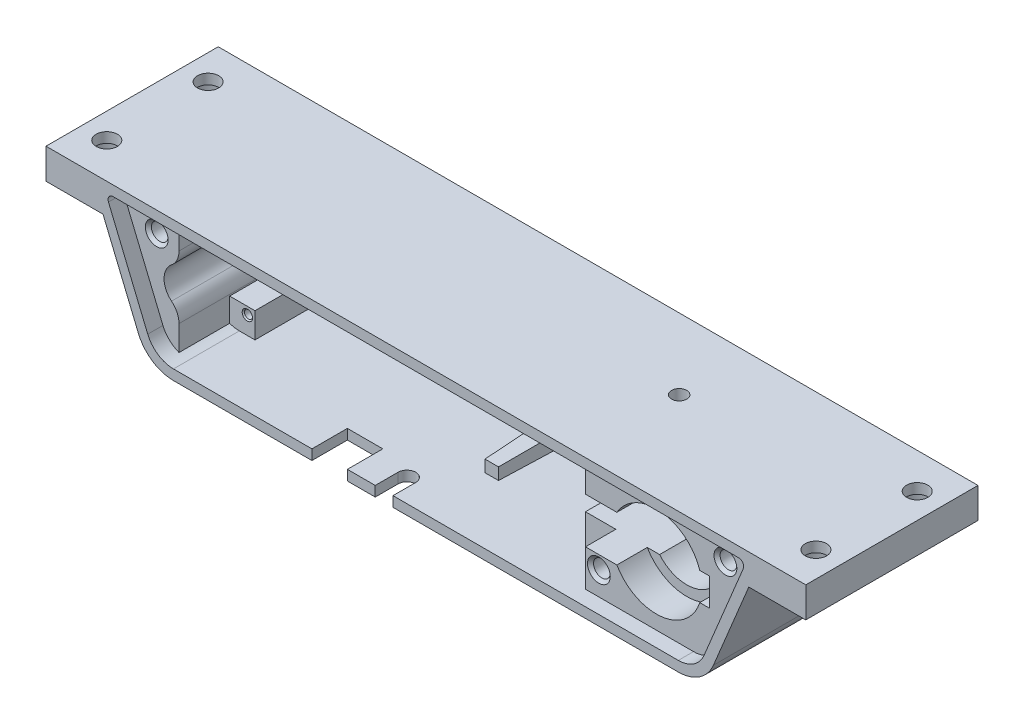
ISO-10303-21;
HEADER;
FILE_DESCRIPTION(('STEP AP214'),'2;1');
FILE_NAME('part.step','',(''),(''),'','','');
FILE_SCHEMA(('AUTOMOTIVE_DESIGN { 1 0 10303 214 1 1 1 1 }'));
ENDSEC;
DATA;
#1=APPLICATION_CONTEXT('core data for automotive mechanical design processes');
#2=APPLICATION_PROTOCOL_DEFINITION('international standard','automotive_design',2000,#1);
#3=PRODUCT_CONTEXT('',#1,'mechanical');
#4=PRODUCT('Part','Part','',(#3));
#5=PRODUCT_RELATED_PRODUCT_CATEGORY('part','',(#4));
#6=PRODUCT_DEFINITION_FORMATION('','',#4);
#7=PRODUCT_DEFINITION_CONTEXT('part definition',#1,'design');
#8=PRODUCT_DEFINITION('design','',#6,#7);
#9=PRODUCT_DEFINITION_SHAPE('','',#8);
#10=(LENGTH_UNIT() NAMED_UNIT(*) SI_UNIT(.MILLI.,.METRE.));
#11=(NAMED_UNIT(*) PLANE_ANGLE_UNIT() SI_UNIT($,.RADIAN.));
#12=(NAMED_UNIT(*) SI_UNIT($,.STERADIAN.) SOLID_ANGLE_UNIT());
#13=UNCERTAINTY_MEASURE_WITH_UNIT(LENGTH_MEASURE(1.E-05),#10,'distance_accuracy_value','');
#14=(GEOMETRIC_REPRESENTATION_CONTEXT(3) GLOBAL_UNCERTAINTY_ASSIGNED_CONTEXT((#13)) GLOBAL_UNIT_ASSIGNED_CONTEXT((#10,
#11,#12)) REPRESENTATION_CONTEXT('',''));
#15=CARTESIAN_POINT('',(0.,0.,0.));
#16=DIRECTION('',(0.,0.,1.));
#17=DIRECTION('',(1.,0.,0.));
#18=AXIS2_PLACEMENT_3D('',#15,#16,#17);
#19=CARTESIAN_POINT('',(-75.,-6.,34.));
#20=DIRECTION('',(0.,1.,0.));
#21=DIRECTION('',(-1.,0.,0.));
#22=AXIS2_PLACEMENT_3D('',#19,#20,#21);
#23=PLANE('',#22);
#24=DIRECTION('',(1.,0.,0.));
#25=VECTOR('',#24,1.);
#26=CARTESIAN_POINT('',(-75.,-6.,0.));
#27=LINE('',#26,#25);
#28=CARTESIAN_POINT('',(-75.,-6.,0.));
#29=VERTEX_POINT('',#28);
#30=CARTESIAN_POINT('',(-63.75,-6.,0.));
#31=VERTEX_POINT('',#30);
#32=EDGE_CURVE('E781',#29,#31,#27,.T.);
#33=ORIENTED_EDGE('',*,*,#32,.T.);
#34=DIRECTION('',(0.,0.,-1.));
#35=VECTOR('',#34,1.);
#36=CARTESIAN_POINT('',(-63.75,-6.,34.));
#37=LINE('',#36,#35);
#38=CARTESIAN_POINT('',(-63.75,-6.,34.));
#39=VERTEX_POINT('',#38);
#40=EDGE_CURVE('E811',#39,#31,#37,.T.);
#41=ORIENTED_EDGE('',*,*,#40,.F.);
#42=DIRECTION('',(1.,0.,0.));
#43=VECTOR('',#42,1.);
#44=CARTESIAN_POINT('',(-75.,-6.,34.));
#45=LINE('',#44,#43);
#46=CARTESIAN_POINT('',(-75.,-6.,34.));
#47=VERTEX_POINT('',#46);
#48=EDGE_CURVE('E757',#47,#39,#45,.T.);
#49=ORIENTED_EDGE('',*,*,#48,.F.);
#50=DIRECTION('',(0.,0.,-1.));
#51=VECTOR('',#50,1.);
#52=CARTESIAN_POINT('',(-75.,-6.,34.));
#53=LINE('',#52,#51);
#54=EDGE_CURVE('E814',#47,#29,#53,.T.);
#55=ORIENTED_EDGE('',*,*,#54,.T.);
#56=EDGE_LOOP('',(#33,#41,#49,#55));
#57=FACE_BOUND('',#56,.T.);
#58=CARTESIAN_POINT('',(-70.,-6.,7.));
#59=DIRECTION('',(0.,-1.,0.));
#60=DIRECTION('',(0.,0.,-1.));
#61=AXIS2_PLACEMENT_3D('',#58,#59,#60);
#62=CIRCLE('',#61,4.24999999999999);
#63=CARTESIAN_POINT('',(-70.,-6.,2.75000000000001));
#64=VERTEX_POINT('',#63);
#65=EDGE_CURVE('E2104',#64,#64,#62,.T.);
#66=ORIENTED_EDGE('',*,*,#65,.F.);
#67=EDGE_LOOP('',(#66));
#68=FACE_BOUND('',#67,.T.);
#69=CARTESIAN_POINT('',(-70.,-6.,27.));
#70=DIRECTION('',(0.,-1.,0.));
#71=DIRECTION('',(0.,0.,-1.));
#72=AXIS2_PLACEMENT_3D('',#69,#70,#71);
#73=CIRCLE('',#72,4.24999999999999);
#74=CARTESIAN_POINT('',(-70.,-6.,22.75));
#75=VERTEX_POINT('',#74);
#76=EDGE_CURVE('E2092',#75,#75,#73,.T.);
#77=ORIENTED_EDGE('',*,*,#76,.F.);
#78=EDGE_LOOP('',(#77));
#79=FACE_BOUND('',#78,.T.);
#80=ADVANCED_FACE('F39',(#57,#68,#79),#23,.F.);
#81=CARTESIAN_POINT('',(75.,-6.,34.));
#82=DIRECTION('',(0.,1.,0.));
#83=DIRECTION('',(-1.,0.,0.));
#84=AXIS2_PLACEMENT_3D('',#81,#82,#83);
#85=PLANE('',#84);
#86=CARTESIAN_POINT('',(70.,-6.00000000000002,27.));
#87=DIRECTION('',(0.,-1.,0.));
#88=DIRECTION('',(0.,0.,-1.));
#89=AXIS2_PLACEMENT_3D('',#86,#87,#88);
#90=CIRCLE('',#89,4.24999999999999);
#91=CARTESIAN_POINT('',(70.,-6.00000000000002,22.75));
#92=VERTEX_POINT('',#91);
#93=EDGE_CURVE('E2116',#92,#92,#90,.T.);
#94=ORIENTED_EDGE('',*,*,#93,.F.);
#95=EDGE_LOOP('',(#94));
#96=FACE_BOUND('',#95,.T.);
#97=DIRECTION('',(1.,0.,0.));
#98=VECTOR('',#97,1.);
#99=CARTESIAN_POINT('',(75.,-6.,0.));
#100=LINE('',#99,#98);
#101=CARTESIAN_POINT('',(63.75,-6.,0.));
#102=VERTEX_POINT('',#101);
#103=CARTESIAN_POINT('',(75.,-6.,0.));
#104=VERTEX_POINT('',#103);
#105=EDGE_CURVE('E753',#102,#104,#100,.T.);
#106=ORIENTED_EDGE('',*,*,#105,.T.);
#107=DIRECTION('',(0.,0.,-1.));
#108=VECTOR('',#107,1.);
#109=CARTESIAN_POINT('',(75.,-6.,34.));
#110=LINE('',#109,#108);
#111=CARTESIAN_POINT('',(75.,-6.,34.));
#112=VERTEX_POINT('',#111);
#113=EDGE_CURVE('E774',#112,#104,#110,.T.);
#114=ORIENTED_EDGE('',*,*,#113,.F.);
#115=DIRECTION('',(1.,0.,0.));
#116=VECTOR('',#115,1.);
#117=CARTESIAN_POINT('',(75.,-6.,34.));
#118=LINE('',#117,#116);
#119=CARTESIAN_POINT('',(63.75,-6.,34.));
#120=VERTEX_POINT('',#119);
#121=EDGE_CURVE('E772',#120,#112,#118,.T.);
#122=ORIENTED_EDGE('',*,*,#121,.F.);
#123=DIRECTION('',(0.,0.,-1.));
#124=VECTOR('',#123,1.);
#125=CARTESIAN_POINT('',(63.75,-6.,34.));
#126=LINE('',#125,#124);
#127=EDGE_CURVE('E796',#120,#102,#126,.T.);
#128=ORIENTED_EDGE('',*,*,#127,.T.);
#129=EDGE_LOOP('',(#106,#114,#122,#128));
#130=FACE_BOUND('',#129,.T.);
#131=CARTESIAN_POINT('',(70.,-6.00000000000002,7.));
#132=DIRECTION('',(0.,-1.,0.));
#133=DIRECTION('',(0.,0.,-1.));
#134=AXIS2_PLACEMENT_3D('',#131,#132,#133);
#135=CIRCLE('',#134,4.24999999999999);
#136=CARTESIAN_POINT('',(70.,-6.00000000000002,2.75000000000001));
#137=VERTEX_POINT('',#136);
#138=EDGE_CURVE('E1260',#137,#137,#135,.T.);
#139=ORIENTED_EDGE('',*,*,#138,.F.);
#140=EDGE_LOOP('',(#139));
#141=FACE_BOUND('',#140,.T.);
#142=ADVANCED_FACE('F881',(#96,#130,#141),#85,.F.);
#143=CARTESIAN_POINT('',(49.8330686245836,-20.,34.));
#144=DIRECTION('',(0.,0.,1.));
#145=DIRECTION('',(1.,0.,0.));
#146=AXIS2_PLACEMENT_3D('',#143,#144,#145);
#147=PLANE('',#146);
#148=DIRECTION('',(0.,-1.,0.));
#149=VECTOR('',#148,1.);
#150=CARTESIAN_POINT('',(-6.5,0.001000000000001,34.));
#151=LINE('',#150,#149);
#152=CARTESIAN_POINT('',(-6.5,-25.5,34.));
#153=VERTEX_POINT('',#152);
#154=CARTESIAN_POINT('',(-6.5,-27.5,34.));
#155=VERTEX_POINT('',#154);
#156=EDGE_CURVE('E992',#153,#155,#151,.T.);
#157=ORIENTED_EDGE('',*,*,#156,.T.);
#158=DIRECTION('',(1.,0.,0.));
#159=VECTOR('',#158,1.);
#160=CARTESIAN_POINT('',(49.8330686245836,-27.5,34.));
#161=LINE('',#160,#159);
#162=CARTESIAN_POINT('',(49.8330686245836,-27.5,34.));
#163=VERTEX_POINT('',#162);
#164=EDGE_CURVE('E763',#155,#163,#161,.T.);
#165=ORIENTED_EDGE('',*,*,#164,.T.);
#166=CARTESIAN_POINT('',(49.8330686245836,-20.,34.));
#167=DIRECTION('',(0.,0.,1.));
#168=DIRECTION('',(1.,0.,0.));
#169=AXIS2_PLACEMENT_3D('',#166,#167,#168);
#170=CIRCLE('',#169,7.5);
#171=CARTESIAN_POINT('',(56.7621651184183,-22.8701257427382,34.));
#172=VERTEX_POINT('',#171);
#173=EDGE_CURVE('E767',#163,#172,#170,.T.);
#174=ORIENTED_EDGE('',*,*,#173,.T.);
#175=DIRECTION('',(0.382683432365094,0.923879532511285,0.));
#176=VECTOR('',#175,1.);
#177=CARTESIAN_POINT('',(63.75,-6.,34.));
#178=LINE('',#177,#176);
#179=EDGE_CURVE('E770',#172,#120,#178,.T.);
#180=ORIENTED_EDGE('',*,*,#179,.T.);
#181=ORIENTED_EDGE('',*,*,#121,.T.);
#182=DIRECTION('',(0.,1.,0.));
#183=VECTOR('',#182,1.);
#184=CARTESIAN_POINT('',(75.,0.,34.));
#185=LINE('',#184,#183);
#186=CARTESIAN_POINT('',(75.,0.,34.));
#187=VERTEX_POINT('',#186);
#188=EDGE_CURVE('E749',#112,#187,#185,.T.);
#189=ORIENTED_EDGE('',*,*,#188,.T.);
#190=DIRECTION('',(-1.,0.,0.));
#191=VECTOR('',#190,1.);
#192=CARTESIAN_POINT('',(-75.,0.,34.));
#193=LINE('',#192,#191);
#194=CARTESIAN_POINT('',(-75.,0.,34.));
#195=VERTEX_POINT('',#194);
#196=EDGE_CURVE('E752',#187,#195,#193,.T.);
#197=ORIENTED_EDGE('',*,*,#196,.T.);
#198=DIRECTION('',(0.,-1.,0.));
#199=VECTOR('',#198,1.);
#200=CARTESIAN_POINT('',(-75.,0.,34.));
#201=LINE('',#200,#199);
#202=EDGE_CURVE('E755',#195,#47,#201,.T.);
#203=ORIENTED_EDGE('',*,*,#202,.T.);
#204=ORIENTED_EDGE('',*,*,#48,.T.);
#205=DIRECTION('',(0.382683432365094,-0.923879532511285,0.));
#206=VECTOR('',#205,1.);
#207=CARTESIAN_POINT('',(-63.75,-6.,34.));
#208=LINE('',#207,#206);
#209=CARTESIAN_POINT('',(-56.7621651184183,-22.8701257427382,34.));
#210=VERTEX_POINT('',#209);
#211=EDGE_CURVE('E759',#39,#210,#208,.T.);
#212=ORIENTED_EDGE('',*,*,#211,.T.);
#213=CARTESIAN_POINT('',(-49.8330686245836,-20.,34.));
#214=DIRECTION('',(0.,0.,1.));
#215=DIRECTION('',(-1.,0.,0.));
#216=AXIS2_PLACEMENT_3D('',#213,#214,#215);
#217=CIRCLE('',#216,7.5);
#218=CARTESIAN_POINT('',(-49.8330686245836,-27.5,34.));
#219=VERTEX_POINT('',#218);
#220=EDGE_CURVE('E761',#210,#219,#217,.T.);
#221=ORIENTED_EDGE('',*,*,#220,.T.);
#222=CARTESIAN_POINT('',(-22.5,-27.5,34.));
#223=VERTEX_POINT('',#222);
#224=EDGE_CURVE('E764',#219,#223,#161,.T.);
#225=ORIENTED_EDGE('',*,*,#224,.T.);
#226=DIRECTION('',(0.,-1.,0.));
#227=VECTOR('',#226,1.);
#228=CARTESIAN_POINT('',(-22.5,-25.5,34.));
#229=LINE('',#228,#227);
#230=CARTESIAN_POINT('',(-22.5,-25.5,34.));
#231=VERTEX_POINT('',#230);
#232=EDGE_CURVE('E1038',#231,#223,#229,.T.);
#233=ORIENTED_EDGE('',*,*,#232,.F.);
#234=DIRECTION('',(1.,0.,0.));
#235=VECTOR('',#234,1.);
#236=CARTESIAN_POINT('',(-49.8330686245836,-25.5,34.));
#237=LINE('',#236,#235);
#238=CARTESIAN_POINT('',(-49.8330686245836,-25.5,34.));
#239=VERTEX_POINT('',#238);
#240=EDGE_CURVE('E731',#239,#231,#237,.T.);
#241=ORIENTED_EDGE('',*,*,#240,.F.);
#242=CARTESIAN_POINT('',(-49.8330686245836,-20.,34.));
#243=DIRECTION('',(0.,0.,1.));
#244=DIRECTION('',(1.,0.,0.));
#245=AXIS2_PLACEMENT_3D('',#242,#243,#244);
#246=CIRCLE('',#245,5.5);
#247=CARTESIAN_POINT('',(-54.9144060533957,-22.104758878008,34.));
#248=VERTEX_POINT('',#247);
#249=EDGE_CURVE('E727',#248,#239,#246,.T.);
#250=ORIENTED_EDGE('',*,*,#249,.F.);
#251=DIRECTION('',(0.382683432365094,-0.923879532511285,0.));
#252=VECTOR('',#251,1.);
#253=CARTESIAN_POINT('',(-63.2420698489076,-2.,34.));
#254=LINE('',#253,#252);
#255=CARTESIAN_POINT('',(-62.6693436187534,-3.38268343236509,34.));
#256=VERTEX_POINT('',#255);
#257=EDGE_CURVE('E520',#256,#248,#254,.T.);
#258=ORIENTED_EDGE('',*,*,#257,.F.);
#259=CARTESIAN_POINT('',(-61.7454640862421,-3.,34.));
#260=DIRECTION('',(0.,0.,1.));
#261=DIRECTION('',(1.,0.,0.));
#262=AXIS2_PLACEMENT_3D('',#259,#260,#261);
#263=CIRCLE('',#262,1.);
#264=CARTESIAN_POINT('',(-61.7454640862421,-2.,34.));
#265=VERTEX_POINT('',#264);
#266=EDGE_CURVE('E48',#256,#265,#263,.F.);
#267=ORIENTED_EDGE('',*,*,#266,.T.);
#268=DIRECTION('',(-1.,0.,0.));
#269=VECTOR('',#268,1.);
#270=CARTESIAN_POINT('',(63.2420698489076,-2.,34.));
#271=LINE('',#270,#269);
#272=CARTESIAN_POINT('',(61.7454640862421,-2.,34.));
#273=VERTEX_POINT('',#272);
#274=EDGE_CURVE('E518',#273,#265,#271,.T.);
#275=ORIENTED_EDGE('',*,*,#274,.F.);
#276=CARTESIAN_POINT('',(61.7454640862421,-3.,34.));
#277=DIRECTION('',(0.,0.,1.));
#278=DIRECTION('',(1.,0.,0.));
#279=AXIS2_PLACEMENT_3D('',#276,#277,#278);
#280=CIRCLE('',#279,1.);
#281=CARTESIAN_POINT('',(62.6693436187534,-3.3826834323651,34.));
#282=VERTEX_POINT('',#281);
#283=EDGE_CURVE('E12',#273,#282,#280,.F.);
#284=ORIENTED_EDGE('',*,*,#283,.T.);
#285=DIRECTION('',(0.382683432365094,0.923879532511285,0.));
#286=VECTOR('',#285,1.);
#287=CARTESIAN_POINT('',(54.9144060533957,-22.104758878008,34.));
#288=LINE('',#287,#286);
#289=CARTESIAN_POINT('',(54.9144060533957,-22.104758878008,34.));
#290=VERTEX_POINT('',#289);
#291=EDGE_CURVE('E738',#290,#282,#288,.T.);
#292=ORIENTED_EDGE('',*,*,#291,.F.);
#293=CARTESIAN_POINT('',(49.8330686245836,-20.,34.));
#294=DIRECTION('',(0.,0.,1.));
#295=DIRECTION('',(1.,0.,0.));
#296=AXIS2_PLACEMENT_3D('',#293,#294,#295);
#297=CIRCLE('',#296,5.5);
#298=CARTESIAN_POINT('',(49.8330686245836,-25.5,34.));
#299=VERTEX_POINT('',#298);
#300=EDGE_CURVE('E734',#299,#290,#297,.T.);
#301=ORIENTED_EDGE('',*,*,#300,.F.);
#302=EDGE_CURVE('E730',#153,#299,#237,.T.);
#303=ORIENTED_EDGE('',*,*,#302,.F.);
#304=EDGE_LOOP('',(#157,#165,#174,#180,#181,#189,#197,#203,#204,#212,#221,#225,#233,#241,#250,
#258,#267,#275,#284,#292,#301,#303));
#305=FACE_BOUND('',#304,.T.);
#306=ADVANCED_FACE('F517',(#305),#147,.T.);
#307=CARTESIAN_POINT('',(49.8330686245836,-20.,2.));
#308=DIRECTION('',(0.,0.,1.));
#309=DIRECTION('',(1.,0.,0.));
#310=AXIS2_PLACEMENT_3D('',#307,#308,#309);
#311=PLANE('',#310);
#312=CARTESIAN_POINT('',(-50.6947616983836,-14.,2.));
#313=DIRECTION('',(0.,0.,1.));
#314=DIRECTION('',(1.,0.,0.));
#315=AXIS2_PLACEMENT_3D('',#312,#313,#314);
#316=CIRCLE('',#315,4.00000000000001);
#317=CARTESIAN_POINT('',(-53.2184157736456,-17.1034126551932,2.));
#318=VERTEX_POINT('',#317);
#319=CARTESIAN_POINT('',(-53.2184157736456,-10.8965873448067,2.));
#320=VERTEX_POINT('',#319);
#321=EDGE_CURVE('E451',#318,#320,#316,.T.);
#322=ORIENTED_EDGE('',*,*,#321,.F.);
#323=CARTESIAN_POINT('',(-55.7420698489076,-20.2068253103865,2.));
#324=DIRECTION('',(0.,0.,1.));
#325=DIRECTION('',(1.,0.,0.));
#326=AXIS2_PLACEMENT_3D('',#323,#324,#325);
#327=CIRCLE('',#326,4.);
#328=CARTESIAN_POINT('',(-51.7420698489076,-20.2068253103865,2.));
#329=VERTEX_POINT('',#328);
#330=EDGE_CURVE('E476',#318,#329,#327,.F.);
#331=ORIENTED_EDGE('',*,*,#330,.T.);
#332=DIRECTION('',(0.,1.,0.));
#333=VECTOR('',#332,1.);
#334=CARTESIAN_POINT('',(-51.7420698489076,-17.8604592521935,2.));
#335=LINE('',#334,#333);
#336=CARTESIAN_POINT('',(-51.7420698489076,-20.5,2.));
#337=VERTEX_POINT('',#336);
#338=EDGE_CURVE('E557',#337,#329,#335,.T.);
#339=ORIENTED_EDGE('',*,*,#338,.F.);
#340=DIRECTION('',(-1.,0.,0.));
#341=VECTOR('',#340,1.);
#342=CARTESIAN_POINT('',(-51.7420698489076,-20.5,2.));
#343=LINE('',#342,#341);
#344=CARTESIAN_POINT('',(-46.7420698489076,-20.5,2.));
#345=VERTEX_POINT('',#344);
#346=EDGE_CURVE('E1079',#345,#337,#343,.T.);
#347=ORIENTED_EDGE('',*,*,#346,.F.);
#348=DIRECTION('',(0.,1.,0.));
#349=VECTOR('',#348,1.);
#350=CARTESIAN_POINT('',(-46.7420698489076,-20.5,2.));
#351=LINE('',#350,#349);
#352=CARTESIAN_POINT('',(-46.7420698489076,-25.5,2.));
#353=VERTEX_POINT('',#352);
#354=EDGE_CURVE('E1075',#353,#345,#351,.T.);
#355=ORIENTED_EDGE('',*,*,#354,.F.);
#356=DIRECTION('',(-1.,0.,0.));
#357=VECTOR('',#356,1.);
#358=CARTESIAN_POINT('',(-49.8330686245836,-25.5,2.));
#359=LINE('',#358,#357);
#360=CARTESIAN_POINT('',(-1.99999999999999,-25.5,2.));
#361=VERTEX_POINT('',#360);
#362=EDGE_CURVE('E722',#361,#353,#359,.T.);
#363=ORIENTED_EDGE('',*,*,#362,.F.);
#364=DIRECTION('',(0.,-1.,0.));
#365=VECTOR('',#364,1.);
#366=CARTESIAN_POINT('',(-2.,-25.5,2.));
#367=LINE('',#366,#365);
#368=CARTESIAN_POINT('',(-1.99999999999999,-22.5,2.));
#369=VERTEX_POINT('',#368);
#370=EDGE_CURVE('E693',#369,#361,#367,.T.);
#371=ORIENTED_EDGE('',*,*,#370,.F.);
#372=DIRECTION('',(-1.,0.,0.));
#373=VECTOR('',#372,1.);
#374=CARTESIAN_POINT('',(-2.,-22.5,2.));
#375=LINE('',#374,#373);
#376=CARTESIAN_POINT('',(2.,-22.5,2.));
#377=VERTEX_POINT('',#376);
#378=EDGE_CURVE('E704',#377,#369,#375,.T.);
#379=ORIENTED_EDGE('',*,*,#378,.F.);
#380=DIRECTION('',(0.,1.,0.));
#381=VECTOR('',#380,1.);
#382=CARTESIAN_POINT('',(2.,-25.5,2.));
#383=LINE('',#382,#381);
#384=CARTESIAN_POINT('',(2.,-25.5,2.));
#385=VERTEX_POINT('',#384);
#386=EDGE_CURVE('E701',#385,#377,#383,.T.);
#387=ORIENTED_EDGE('',*,*,#386,.F.);
#388=CARTESIAN_POINT('',(22.5,-25.5,2.));
#389=VERTEX_POINT('',#388);
#390=EDGE_CURVE('E719',#389,#385,#359,.T.);
#391=ORIENTED_EDGE('',*,*,#390,.F.);
#392=DIRECTION('',(0.,-1.,0.));
#393=VECTOR('',#392,1.);
#394=CARTESIAN_POINT('',(22.5,-25.5,2.));
#395=LINE('',#394,#393);
#396=CARTESIAN_POINT('',(22.5,-18.25,2.));
#397=VERTEX_POINT('',#396);
#398=EDGE_CURVE('E624',#397,#389,#395,.T.);
#399=ORIENTED_EDGE('',*,*,#398,.F.);
#400=DIRECTION('',(-1.,0.,0.));
#401=VECTOR('',#400,1.);
#402=CARTESIAN_POINT('',(22.5,-18.25,2.));
#403=LINE('',#402,#401);
#404=CARTESIAN_POINT('',(37.1380973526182,-18.25,2.));
#405=VERTEX_POINT('',#404);
#406=EDGE_CURVE('E662',#405,#397,#403,.T.);
#407=ORIENTED_EDGE('',*,*,#406,.F.);
#408=CARTESIAN_POINT('',(42.5,-13.75,2.));
#409=DIRECTION('',(0.,0.,-1.));
#410=DIRECTION('',(1.,0.,0.));
#411=AXIS2_PLACEMENT_3D('',#408,#409,#410);
#412=CIRCLE('',#411,6.99999999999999);
#413=CARTESIAN_POINT('',(48.9371965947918,-16.5,2.));
#414=VERTEX_POINT('',#413);
#415=EDGE_CURVE('E660',#414,#405,#412,.T.);
#416=ORIENTED_EDGE('',*,*,#415,.F.);
#417=DIRECTION('',(-1.,0.,0.));
#418=VECTOR('',#417,1.);
#419=CARTESIAN_POINT('',(48.9371965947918,-16.5,2.));
#420=LINE('',#419,#418);
#421=CARTESIAN_POINT('',(53.,-16.5,2.));
#422=VERTEX_POINT('',#421);
#423=EDGE_CURVE('E658',#422,#414,#420,.T.);
#424=ORIENTED_EDGE('',*,*,#423,.F.);
#425=DIRECTION('',(0.,-1.,0.));
#426=VECTOR('',#425,1.);
#427=CARTESIAN_POINT('',(53.,-11.,2.));
#428=LINE('',#427,#426);
#429=CARTESIAN_POINT('',(53.,-11.,2.));
#430=VERTEX_POINT('',#429);
#431=EDGE_CURVE('E656',#430,#422,#428,.T.);
#432=ORIENTED_EDGE('',*,*,#431,.F.);
#433=DIRECTION('',(1.,0.,0.));
#434=VECTOR('',#433,1.);
#435=CARTESIAN_POINT('',(48.9371965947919,-11.,2.));
#436=LINE('',#435,#434);
#437=CARTESIAN_POINT('',(48.9371965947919,-11.,2.));
#438=VERTEX_POINT('',#437);
#439=EDGE_CURVE('E654',#438,#430,#436,.T.);
#440=ORIENTED_EDGE('',*,*,#439,.F.);
#441=CARTESIAN_POINT('',(42.5,-13.75,2.));
#442=DIRECTION('',(0.,0.,-1.));
#443=DIRECTION('',(1.,0.,0.));
#444=AXIS2_PLACEMENT_3D('',#441,#442,#443);
#445=CIRCLE('',#444,7.);
#446=CARTESIAN_POINT('',(37.1380973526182,-9.25,2.));
#447=VERTEX_POINT('',#446);
#448=EDGE_CURVE('E652',#447,#438,#445,.T.);
#449=ORIENTED_EDGE('',*,*,#448,.F.);
#450=DIRECTION('',(1.,0.,0.));
#451=VECTOR('',#450,1.);
#452=CARTESIAN_POINT('',(22.5,-9.25,2.));
#453=LINE('',#452,#451);
#454=CARTESIAN_POINT('',(22.5,-9.25,2.));
#455=VERTEX_POINT('',#454);
#456=EDGE_CURVE('E650',#455,#447,#453,.T.);
#457=ORIENTED_EDGE('',*,*,#456,.F.);
#458=DIRECTION('',(0.,-1.,0.));
#459=VECTOR('',#458,1.);
#460=CARTESIAN_POINT('',(22.5,-2.,2.));
#461=LINE('',#460,#459);
#462=CARTESIAN_POINT('',(22.5,-2.,2.));
#463=VERTEX_POINT('',#462);
#464=EDGE_CURVE('E620',#463,#455,#461,.T.);
#465=ORIENTED_EDGE('',*,*,#464,.F.);
#466=DIRECTION('',(1.,0.,0.));
#467=VECTOR('',#466,1.);
#468=CARTESIAN_POINT('',(63.2420698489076,-2.,2.));
#469=LINE('',#468,#467);
#470=CARTESIAN_POINT('',(2.,-2.,2.));
#471=VERTEX_POINT('',#470);
#472=EDGE_CURVE('E721',#471,#463,#469,.T.);
#473=ORIENTED_EDGE('',*,*,#472,.F.);
#474=DIRECTION('',(0.,1.,0.));
#475=VECTOR('',#474,1.);
#476=CARTESIAN_POINT('',(2.,-2.,2.));
#477=LINE('',#476,#475);
#478=CARTESIAN_POINT('',(2.,-5.,2.));
#479=VERTEX_POINT('',#478);
#480=EDGE_CURVE('E711',#479,#471,#477,.T.);
#481=ORIENTED_EDGE('',*,*,#480,.F.);
#482=DIRECTION('',(1.,0.,0.));
#483=VECTOR('',#482,1.);
#484=CARTESIAN_POINT('',(-2.,-5.,2.));
#485=LINE('',#484,#483);
#486=CARTESIAN_POINT('',(-1.99999999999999,-5.,2.));
#487=VERTEX_POINT('',#486);
#488=EDGE_CURVE('E717',#487,#479,#485,.T.);
#489=ORIENTED_EDGE('',*,*,#488,.F.);
#490=DIRECTION('',(0.,-1.,0.));
#491=VECTOR('',#490,1.);
#492=CARTESIAN_POINT('',(-2.,-2.,2.));
#493=LINE('',#492,#491);
#494=CARTESIAN_POINT('',(-2.,-2.,2.));
#495=VERTEX_POINT('',#494);
#496=EDGE_CURVE('E713',#495,#487,#493,.T.);
#497=ORIENTED_EDGE('',*,*,#496,.F.);
#498=CARTESIAN_POINT('',(-46.7420698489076,-2.,2.));
#499=VERTEX_POINT('',#498);
#500=EDGE_CURVE('E723',#499,#495,#469,.T.);
#501=ORIENTED_EDGE('',*,*,#500,.F.);
#502=DIRECTION('',(0.,1.,0.));
#503=VECTOR('',#502,1.);
#504=CARTESIAN_POINT('',(-46.7420698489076,-2.,2.));
#505=LINE('',#504,#503);
#506=CARTESIAN_POINT('',(-46.7420698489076,-7.,2.));
#507=VERTEX_POINT('',#506);
#508=EDGE_CURVE('E1099',#507,#499,#505,.T.);
#509=ORIENTED_EDGE('',*,*,#508,.F.);
#510=DIRECTION('',(1.,0.,0.));
#511=VECTOR('',#510,1.);
#512=CARTESIAN_POINT('',(-46.7420698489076,-7.,2.));
#513=LINE('',#512,#511);
#514=CARTESIAN_POINT('',(-51.7420698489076,-7.,2.));
#515=VERTEX_POINT('',#514);
#516=EDGE_CURVE('E1103',#515,#507,#513,.T.);
#517=ORIENTED_EDGE('',*,*,#516,.F.);
#518=DIRECTION('',(0.,1.,0.));
#519=VECTOR('',#518,1.);
#520=CARTESIAN_POINT('',(-51.7420698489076,-2.,2.));
#521=LINE('',#520,#519);
#522=CARTESIAN_POINT('',(-51.7420698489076,-7.79317468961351,2.));
#523=VERTEX_POINT('',#522);
#524=EDGE_CURVE('E471',#523,#515,#521,.T.);
#525=ORIENTED_EDGE('',*,*,#524,.F.);
#526=CARTESIAN_POINT('',(-55.7420698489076,-7.79317468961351,2.));
#527=DIRECTION('',(0.,0.,1.));
#528=DIRECTION('',(1.,0.,0.));
#529=AXIS2_PLACEMENT_3D('',#526,#527,#528);
#530=CIRCLE('',#529,4.);
#531=EDGE_CURVE('E467',#523,#320,#530,.F.);
#532=ORIENTED_EDGE('',*,*,#531,.T.);
#533=EDGE_LOOP('',(#322,#331,#339,#347,#355,#363,#371,#379,#387,#391,#399,#407,#416,#424,#432,
#440,#449,#457,#465,#473,#481,#489,#497,#501,#509,#517,#525,#532));
#534=FACE_BOUND('',#533,.T.);
#535=ADVANCED_FACE('F468',(#534),#311,.T.);
#536=CARTESIAN_POINT('',(-49.8330686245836,-25.5,-128.648698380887));
#537=DIRECTION('',(0.,-1.,0.));
#538=DIRECTION('',(1.,0.,0.));
#539=AXIS2_PLACEMENT_3D('',#536,#537,#538);
#540=PLANE('',#539);
#541=CARTESIAN_POINT('',(-8.25,-25.5,29.5));
#542=DIRECTION('',(0.,-1.,0.));
#543=DIRECTION('',(1.,0.,0.));
#544=AXIS2_PLACEMENT_3D('',#541,#542,#543);
#545=CIRCLE('',#544,1.75);
#546=CARTESIAN_POINT('',(-6.5,-25.5,29.5));
#547=VERTEX_POINT('',#546);
#548=CARTESIAN_POINT('',(-10.,-25.5,29.5));
#549=VERTEX_POINT('',#548);
#550=EDGE_CURVE('E1018',#547,#549,#545,.F.);
#551=ORIENTED_EDGE('',*,*,#550,.F.);
#552=DIRECTION('',(0.,0.,-1.));
#553=VECTOR('',#552,1.);
#554=CARTESIAN_POINT('',(-6.5,-25.5,34.));
#555=LINE('',#554,#553);
#556=EDGE_CURVE('E1015',#153,#547,#555,.T.);
#557=ORIENTED_EDGE('',*,*,#556,.F.);
#558=ORIENTED_EDGE('',*,*,#302,.T.);
#559=DIRECTION('',(0.,0.,1.));
#560=VECTOR('',#559,1.);
#561=CARTESIAN_POINT('',(49.8330686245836,-25.5,-128.648698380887));
#562=LINE('',#561,#560);
#563=CARTESIAN_POINT('',(49.8330686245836,-25.5,31.));
#564=VERTEX_POINT('',#563);
#565=EDGE_CURVE('E743',#564,#299,#562,.T.);
#566=ORIENTED_EDGE('',*,*,#565,.F.);
#567=DIRECTION('',(1.,0.,0.));
#568=VECTOR('',#567,1.);
#569=CARTESIAN_POINT('',(28.5,-25.5,31.));
#570=LINE('',#569,#568);
#571=CARTESIAN_POINT('',(28.5,-25.5,31.));
#572=VERTEX_POINT('',#571);
#573=EDGE_CURVE('E588',#572,#564,#570,.T.);
#574=ORIENTED_EDGE('',*,*,#573,.F.);
#575=DIRECTION('',(0.,0.,-1.));
#576=VECTOR('',#575,1.);
#577=CARTESIAN_POINT('',(28.5,-25.5,31.));
#578=LINE('',#577,#576);
#579=CARTESIAN_POINT('',(28.5,-25.5,25.));
#580=VERTEX_POINT('',#579);
#581=EDGE_CURVE('E592',#572,#580,#578,.T.);
#582=ORIENTED_EDGE('',*,*,#581,.T.);
#583=DIRECTION('',(1.,0.,0.));
#584=VECTOR('',#583,1.);
#585=CARTESIAN_POINT('',(49.8330686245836,-25.5,25.));
#586=LINE('',#585,#584);
#587=CARTESIAN_POINT('',(22.5,-25.5,25.));
#588=VERTEX_POINT('',#587);
#589=EDGE_CURVE('E645',#588,#580,#586,.T.);
#590=ORIENTED_EDGE('',*,*,#589,.F.);
#591=DIRECTION('',(0.,0.,-1.));
#592=VECTOR('',#591,1.);
#593=CARTESIAN_POINT('',(22.5,-25.5,25.));
#594=LINE('',#593,#592);
#595=EDGE_CURVE('E648',#588,#389,#594,.T.);
#596=ORIENTED_EDGE('',*,*,#595,.T.);
#597=ORIENTED_EDGE('',*,*,#390,.T.);
#598=DIRECTION('',(-0.034899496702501,0.,0.999390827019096));
#599=VECTOR('',#598,1.);
#600=CARTESIAN_POINT('',(6.49366487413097,-25.5,-126.681725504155));
#601=LINE('',#600,#599);
#602=CARTESIAN_POINT('',(1.3365053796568,-25.5,21.));
#603=VERTEX_POINT('',#602);
#604=EDGE_CURVE('E822',#603,#385,#601,.F.);
#605=ORIENTED_EDGE('',*,*,#604,.F.);
#606=DIRECTION('',(1.,0.,0.));
#607=VECTOR('',#606,1.);
#608=CARTESIAN_POINT('',(-2.,-25.5,21.));
#609=LINE('',#608,#607);
#610=CARTESIAN_POINT('',(-1.33650537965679,-25.5,21.));
#611=VERTEX_POINT('',#610);
#612=EDGE_CURVE('E694',#611,#603,#609,.T.);
#613=ORIENTED_EDGE('',*,*,#612,.F.);
#614=DIRECTION('',(0.034899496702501,0.,0.999390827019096));
#615=VECTOR('',#614,1.);
#616=CARTESIAN_POINT('',(-2.,-25.5,2.));
#617=LINE('',#616,#615);
#618=EDGE_CURVE('E714',#611,#361,#617,.F.);
#619=ORIENTED_EDGE('',*,*,#618,.T.);
#620=ORIENTED_EDGE('',*,*,#362,.T.);
#621=DIRECTION('',(0.,0.,-1.));
#622=VECTOR('',#621,1.);
#623=CARTESIAN_POINT('',(-46.7420698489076,-25.5,21.));
#624=LINE('',#623,#622);
#625=CARTESIAN_POINT('',(-46.7420698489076,-25.5,21.));
#626=VERTEX_POINT('',#625);
#627=EDGE_CURVE('E1096',#626,#353,#624,.T.);
#628=ORIENTED_EDGE('',*,*,#627,.F.);
#629=DIRECTION('',(1.,0.,0.));
#630=VECTOR('',#629,1.);
#631=CARTESIAN_POINT('',(-49.8330686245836,-25.5,21.));
#632=LINE('',#631,#630);
#633=CARTESIAN_POINT('',(-49.8330686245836,-25.5,21.));
#634=VERTEX_POINT('',#633);
#635=EDGE_CURVE('E1081',#634,#626,#632,.T.);
#636=ORIENTED_EDGE('',*,*,#635,.F.);
#637=DIRECTION('',(0.,0.,1.));
#638=VECTOR('',#637,1.);
#639=CARTESIAN_POINT('',(-49.8330686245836,-25.5,-128.648698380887));
#640=LINE('',#639,#638);
#641=EDGE_CURVE('E746',#634,#239,#640,.T.);
#642=ORIENTED_EDGE('',*,*,#641,.T.);
#643=ORIENTED_EDGE('',*,*,#240,.T.);
#644=DIRECTION('',(0.,0.,1.));
#645=VECTOR('',#644,1.);
#646=CARTESIAN_POINT('',(-22.5,-25.5,27.));
#647=LINE('',#646,#645);
#648=CARTESIAN_POINT('',(-22.5,-25.5,27.));
#649=VERTEX_POINT('',#648);
#650=EDGE_CURVE('E1041',#649,#231,#647,.T.);
#651=ORIENTED_EDGE('',*,*,#650,.F.);
#652=DIRECTION('',(-1.,0.,0.));
#653=VECTOR('',#652,1.);
#654=CARTESIAN_POINT('',(-22.5,-25.5,27.));
#655=LINE('',#654,#653);
#656=CARTESIAN_POINT('',(-15.5,-25.5,27.));
#657=VERTEX_POINT('',#656);
#658=EDGE_CURVE('E1034',#657,#649,#655,.T.);
#659=ORIENTED_EDGE('',*,*,#658,.F.);
#660=DIRECTION('',(0.,0.,1.));
#661=VECTOR('',#660,1.);
#662=CARTESIAN_POINT('',(-15.5,-25.5,27.));
#663=LINE('',#662,#661);
#664=CARTESIAN_POINT('',(-15.5,-25.5,34.));
#665=VERTEX_POINT('',#664);
#666=EDGE_CURVE('E1044',#657,#665,#663,.T.);
#667=ORIENTED_EDGE('',*,*,#666,.T.);
#668=CARTESIAN_POINT('',(-10.,-25.5,34.));
#669=VERTEX_POINT('',#668);
#670=EDGE_CURVE('E735',#665,#669,#237,.T.);
#671=ORIENTED_EDGE('',*,*,#670,.T.);
#672=DIRECTION('',(0.,0.,1.));
#673=VECTOR('',#672,1.);
#674=CARTESIAN_POINT('',(-10.,-25.5,34.));
#675=LINE('',#674,#673);
#676=EDGE_CURVE('E55',#549,#669,#675,.T.);
#677=ORIENTED_EDGE('',*,*,#676,.F.);
#678=EDGE_LOOP('',(#551,#557,#558,#566,#574,#582,#590,#596,#597,#605,#613,#619,#620,#628,#636,
#642,#643,#651,#659,#667,#671,#677));
#679=FACE_BOUND('',#678,.T.);
#680=ADVANCED_FACE('F1148',(#679),#540,.F.);
#681=CARTESIAN_POINT('',(-51.7420698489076,-17.8604592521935,56.8562629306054));
#682=DIRECTION('',(-1.,0.,0.));
#683=DIRECTION('',(0.,0.,1.));
#684=AXIS2_PLACEMENT_3D('',#681,#682,#683);
#685=PLANE('',#684);
#686=DIRECTION('',(0.,0.,-1.));
#687=VECTOR('',#686,1.);
#688=CARTESIAN_POINT('',(-51.7420698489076,-20.5,21.));
#689=LINE('',#688,#687);
#690=CARTESIAN_POINT('',(-51.7420698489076,-20.5,21.));
#691=VERTEX_POINT('',#690);
#692=EDGE_CURVE('E1088',#691,#337,#689,.T.);
#693=ORIENTED_EDGE('',*,*,#692,.T.);
#694=ORIENTED_EDGE('',*,*,#338,.T.);
#695=DIRECTION('',(0.,0.,-1.));
#696=VECTOR('',#695,1.);
#697=CARTESIAN_POINT('',(-51.7420698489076,-20.2068253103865,56.8562629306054));
#698=LINE('',#697,#696);
#699=CARTESIAN_POINT('',(-51.7420698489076,-20.2068253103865,31.));
#700=VERTEX_POINT('',#699);
#701=EDGE_CURVE('E483',#329,#700,#698,.F.);
#702=ORIENTED_EDGE('',*,*,#701,.T.);
#703=DIRECTION('',(0.,1.,0.));
#704=VECTOR('',#703,1.);
#705=CARTESIAN_POINT('',(-51.7420698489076,-17.8604592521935,31.));
#706=LINE('',#705,#704);
#707=CARTESIAN_POINT('',(-51.7420698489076,-25.1580727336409,31.));
#708=VERTEX_POINT('',#707);
#709=EDGE_CURVE('E547',#708,#700,#706,.T.);
#710=ORIENTED_EDGE('',*,*,#709,.F.);
#711=DIRECTION('',(0.,0.,-1.));
#712=VECTOR('',#711,1.);
#713=CARTESIAN_POINT('',(-51.7420698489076,-25.1580727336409,56.8562629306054));
#714=LINE('',#713,#712);
#715=CARTESIAN_POINT('',(-51.7420698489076,-25.1580727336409,21.));
#716=VERTEX_POINT('',#715);
#717=EDGE_CURVE('E554',#708,#716,#714,.T.);
#718=ORIENTED_EDGE('',*,*,#717,.T.);
#719=DIRECTION('',(0.,-1.,0.));
#720=VECTOR('',#719,1.);
#721=CARTESIAN_POINT('',(-51.7420698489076,-25.1580727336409,21.));
#722=LINE('',#721,#720);
#723=EDGE_CURVE('E1076',#691,#716,#722,.T.);
#724=ORIENTED_EDGE('',*,*,#723,.F.);
#725=EDGE_LOOP('',(#693,#694,#702,#710,#718,#724));
#726=FACE_BOUND('',#725,.T.);
#727=ADVANCED_FACE('F941',(#726),#685,.F.);
#728=CARTESIAN_POINT('',(63.2420698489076,-2.,-128.648698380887));
#729=DIRECTION('',(0.,1.,0.));
#730=DIRECTION('',(-1.,0.,0.));
#731=AXIS2_PLACEMENT_3D('',#728,#729,#730);
#732=PLANE('',#731);
#733=ORIENTED_EDGE('',*,*,#274,.T.);
#734=DIRECTION('',(0.,0.,1.));
#735=VECTOR('',#734,1.);
#736=CARTESIAN_POINT('',(-61.7454640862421,-2.,31.));
#737=LINE('',#736,#735);
#738=CARTESIAN_POINT('',(-61.7454640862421,-2.,31.));
#739=VERTEX_POINT('',#738);
#740=EDGE_CURVE('E504',#265,#739,#737,.F.);
#741=ORIENTED_EDGE('',*,*,#740,.T.);
#742=DIRECTION('',(-1.,0.,0.));
#743=VECTOR('',#742,1.);
#744=CARTESIAN_POINT('',(-63.2420698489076,-2.,31.));
#745=LINE('',#744,#743);
#746=CARTESIAN_POINT('',(-51.7420698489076,-2.,31.));
#747=VERTEX_POINT('',#746);
#748=EDGE_CURVE('E539',#747,#739,#745,.T.);
#749=ORIENTED_EDGE('',*,*,#748,.F.);
#750=DIRECTION('',(0.,0.,-1.));
#751=VECTOR('',#750,1.);
#752=CARTESIAN_POINT('',(-51.7420698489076,-2.,56.8562629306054));
#753=LINE('',#752,#751);
#754=CARTESIAN_POINT('',(-51.7420698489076,-2.,25.));
#755=VERTEX_POINT('',#754);
#756=EDGE_CURVE('E558',#747,#755,#753,.T.);
#757=ORIENTED_EDGE('',*,*,#756,.T.);
#758=DIRECTION('',(-1.,0.,0.));
#759=VECTOR('',#758,1.);
#760=CARTESIAN_POINT('',(-51.7420698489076,-2.,25.));
#761=LINE('',#760,#759);
#762=CARTESIAN_POINT('',(-46.7420698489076,-2.,25.));
#763=VERTEX_POINT('',#762);
#764=EDGE_CURVE('E1114',#763,#755,#761,.T.);
#765=ORIENTED_EDGE('',*,*,#764,.F.);
#766=DIRECTION('',(0.,0.,-1.));
#767=VECTOR('',#766,1.);
#768=CARTESIAN_POINT('',(-46.7420698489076,-2.,32.0710678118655));
#769=LINE('',#768,#767);
#770=EDGE_CURVE('E1101',#763,#499,#769,.T.);
#771=ORIENTED_EDGE('',*,*,#770,.T.);
#772=ORIENTED_EDGE('',*,*,#500,.T.);
#773=DIRECTION('',(0.034899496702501,0.,0.999390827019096));
#774=VECTOR('',#773,1.);
#775=CARTESIAN_POINT('',(-6.47733304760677,-2.,-126.214043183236));
#776=LINE('',#775,#774);
#777=CARTESIAN_POINT('',(-1.33650537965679,-2.,21.));
#778=VERTEX_POINT('',#777);
#779=EDGE_CURVE('E836',#778,#495,#776,.F.);
#780=ORIENTED_EDGE('',*,*,#779,.F.);
#781=DIRECTION('',(-1.,0.,0.));
#782=VECTOR('',#781,1.);
#783=CARTESIAN_POINT('',(-2.,-2.,21.));
#784=LINE('',#783,#782);
#785=CARTESIAN_POINT('',(1.33650537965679,-2.,21.));
#786=VERTEX_POINT('',#785);
#787=EDGE_CURVE('E707',#786,#778,#784,.T.);
#788=ORIENTED_EDGE('',*,*,#787,.F.);
#789=DIRECTION('',(-0.034899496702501,0.,0.999390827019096));
#790=VECTOR('',#789,1.);
#791=CARTESIAN_POINT('',(2.,-2.,2.));
#792=LINE('',#791,#790);
#793=EDGE_CURVE('E489',#786,#471,#792,.F.);
#794=ORIENTED_EDGE('',*,*,#793,.T.);
#795=ORIENTED_EDGE('',*,*,#472,.T.);
#796=DIRECTION('',(0.,0.,-1.));
#797=VECTOR('',#796,1.);
#798=CARTESIAN_POINT('',(22.5,-2.,25.));
#799=LINE('',#798,#797);
#800=CARTESIAN_POINT('',(22.5,-2.,25.));
#801=VERTEX_POINT('',#800);
#802=EDGE_CURVE('E691',#801,#463,#799,.T.);
#803=ORIENTED_EDGE('',*,*,#802,.F.);
#804=DIRECTION('',(-1.,0.,0.));
#805=VECTOR('',#804,1.);
#806=CARTESIAN_POINT('',(63.2420698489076,-2.,25.));
#807=LINE('',#806,#805);
#808=CARTESIAN_POINT('',(28.5,-2.,25.));
#809=VERTEX_POINT('',#808);
#810=EDGE_CURVE('E621',#809,#801,#807,.T.);
#811=ORIENTED_EDGE('',*,*,#810,.F.);
#812=DIRECTION('',(0.,0.,-1.));
#813=VECTOR('',#812,1.);
#814=CARTESIAN_POINT('',(28.5,-2.,31.));
#815=LINE('',#814,#813);
#816=CARTESIAN_POINT('',(28.5,-2.,31.));
#817=VERTEX_POINT('',#816);
#818=EDGE_CURVE('E618',#817,#809,#815,.T.);
#819=ORIENTED_EDGE('',*,*,#818,.F.);
#820=DIRECTION('',(-1.,0.,0.));
#821=VECTOR('',#820,1.);
#822=CARTESIAN_POINT('',(63.2420698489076,-2.,31.));
#823=LINE('',#822,#821);
#824=CARTESIAN_POINT('',(61.7454640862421,-2.,31.));
#825=VERTEX_POINT('',#824);
#826=EDGE_CURVE('E565',#825,#817,#823,.T.);
#827=ORIENTED_EDGE('',*,*,#826,.F.);
#828=DIRECTION('',(0.,0.,1.));
#829=VECTOR('',#828,1.);
#830=CARTESIAN_POINT('',(61.7454640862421,-2.,34.));
#831=LINE('',#830,#829);
#832=EDGE_CURVE('E501',#825,#273,#831,.T.);
#833=ORIENTED_EDGE('',*,*,#832,.T.);
#834=EDGE_LOOP('',(#733,#741,#749,#757,#765,#771,#772,#780,#788,#794,#795,#803,#811,#819,#827,#833));
#835=FACE_BOUND('',#834,.T.);
#836=ADVANCED_FACE('F525',(#835),#732,.F.);
#837=CARTESIAN_POINT('',(-51.7420698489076,-2.,56.8562629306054));
#838=DIRECTION('',(-1.,0.,0.));
#839=DIRECTION('',(0.,0.,1.));
#840=AXIS2_PLACEMENT_3D('',#837,#838,#839);
#841=PLANE('',#840);
#842=DIRECTION('',(0.,0.,-1.));
#843=VECTOR('',#842,1.);
#844=CARTESIAN_POINT('',(-51.7420698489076,-7.,32.0710678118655));
#845=LINE('',#844,#843);
#846=CARTESIAN_POINT('',(-51.7420698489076,-7.,25.));
#847=VERTEX_POINT('',#846);
#848=EDGE_CURVE('E1098',#847,#515,#845,.T.);
#849=ORIENTED_EDGE('',*,*,#848,.F.);
#850=DIRECTION('',(0.,-1.,0.));
#851=VECTOR('',#850,1.);
#852=CARTESIAN_POINT('',(-51.7420698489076,-7.,25.));
#853=LINE('',#852,#851);
#854=EDGE_CURVE('E1111',#755,#847,#853,.T.);
#855=ORIENTED_EDGE('',*,*,#854,.F.);
#856=ORIENTED_EDGE('',*,*,#756,.F.);
#857=DIRECTION('',(0.,1.,0.));
#858=VECTOR('',#857,1.);
#859=CARTESIAN_POINT('',(-51.7420698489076,-2.,31.));
#860=LINE('',#859,#858);
#861=CARTESIAN_POINT('',(-51.7420698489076,-7.79317468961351,31.));
#862=VERTEX_POINT('',#861);
#863=EDGE_CURVE('E549',#862,#747,#860,.T.);
#864=ORIENTED_EDGE('',*,*,#863,.F.);
#865=DIRECTION('',(0.,0.,-1.));
#866=VECTOR('',#865,1.);
#867=CARTESIAN_POINT('',(-51.7420698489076,-7.79317468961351,56.8562629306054));
#868=LINE('',#867,#866);
#869=EDGE_CURVE('E496',#862,#523,#868,.T.);
#870=ORIENTED_EDGE('',*,*,#869,.T.);
#871=ORIENTED_EDGE('',*,*,#524,.T.);
#872=EDGE_LOOP('',(#849,#855,#856,#864,#870,#871));
#873=FACE_BOUND('',#872,.T.);
#874=ADVANCED_FACE('F940',(#873),#841,.F.);
#875=CARTESIAN_POINT('',(-49.8330686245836,-20.,-128.648698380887));
#876=DIRECTION('',(0.,0.,1.));
#877=DIRECTION('',(1.,0.,0.));
#878=AXIS2_PLACEMENT_3D('',#875,#876,#877);
#879=CYLINDRICAL_SURFACE('',#878,5.5);
#880=ORIENTED_EDGE('',*,*,#641,.F.);
#881=CARTESIAN_POINT('',(-49.8330686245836,-20.,21.));
#882=DIRECTION('',(0.,0.,1.));
#883=DIRECTION('',(1.,0.,0.));
#884=AXIS2_PLACEMENT_3D('',#881,#882,#883);
#885=CIRCLE('',#884,5.49999999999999);
#886=EDGE_CURVE('E1078',#716,#634,#885,.T.);
#887=ORIENTED_EDGE('',*,*,#886,.F.);
#888=ORIENTED_EDGE('',*,*,#717,.F.);
#889=CARTESIAN_POINT('',(-49.8330686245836,-20.,31.));
#890=DIRECTION('',(0.,0.,1.));
#891=DIRECTION('',(1.,0.,0.));
#892=AXIS2_PLACEMENT_3D('',#889,#890,#891);
#893=CIRCLE('',#892,5.5);
#894=CARTESIAN_POINT('',(-54.9144060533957,-22.104758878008,31.));
#895=VERTEX_POINT('',#894);
#896=EDGE_CURVE('E545',#895,#708,#893,.T.);
#897=ORIENTED_EDGE('',*,*,#896,.F.);
#898=DIRECTION('',(0.,0.,1.));
#899=VECTOR('',#898,1.);
#900=CARTESIAN_POINT('',(-54.9144060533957,-22.104758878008,-128.648698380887));
#901=LINE('',#900,#899);
#902=EDGE_CURVE('E544',#895,#248,#901,.T.);
#903=ORIENTED_EDGE('',*,*,#902,.T.);
#904=ORIENTED_EDGE('',*,*,#249,.T.);
#905=EDGE_LOOP('',(#880,#887,#888,#897,#903,#904));
#906=FACE_BOUND('',#905,.T.);
#907=ADVANCED_FACE('F936',(#906),#879,.F.);
#908=CARTESIAN_POINT('',(42.5,-13.75,25.));
#909=DIRECTION('',(0.,0.,1.));
#910=DIRECTION('',(1.,0.,0.));
#911=AXIS2_PLACEMENT_3D('',#908,#909,#910);
#912=PLANE('',#911);
#913=DIRECTION('',(1.,0.,0.));
#914=VECTOR('',#913,1.);
#915=CARTESIAN_POINT('',(22.5,-9.25,25.));
#916=LINE('',#915,#914);
#917=CARTESIAN_POINT('',(22.5,-9.25,25.));
#918=VERTEX_POINT('',#917);
#919=CARTESIAN_POINT('',(28.5,-9.25,25.));
#920=VERTEX_POINT('',#919);
#921=EDGE_CURVE('E627',#918,#920,#916,.T.);
#922=ORIENTED_EDGE('',*,*,#921,.T.);
#923=DIRECTION('',(0.,-1.,0.));
#924=VECTOR('',#923,1.);
#925=CARTESIAN_POINT('',(28.5,-2.,25.));
#926=LINE('',#925,#924);
#927=EDGE_CURVE('E593',#809,#920,#926,.T.);
#928=ORIENTED_EDGE('',*,*,#927,.F.);
#929=ORIENTED_EDGE('',*,*,#810,.T.);
#930=DIRECTION('',(0.,-1.,0.));
#931=VECTOR('',#930,1.);
#932=CARTESIAN_POINT('',(22.5,-2.,25.));
#933=LINE('',#932,#931);
#934=EDGE_CURVE('E623',#801,#918,#933,.T.);
#935=ORIENTED_EDGE('',*,*,#934,.T.);
#936=EDGE_LOOP('',(#922,#928,#929,#935));
#937=FACE_BOUND('',#936,.T.);
#938=ADVANCED_FACE('F1220',(#937),#912,.T.);
#939=DIRECTION('',(1.,0.,0.));
#940=VECTOR('',#939,1.);
#941=CARTESIAN_POINT('',(48.9371965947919,-11.,25.));
#942=LINE('',#941,#940);
#943=CARTESIAN_POINT('',(48.9371965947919,-11.,25.));
#944=VERTEX_POINT('',#943);
#945=CARTESIAN_POINT('',(51.0695682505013,-11.,25.));
#946=VERTEX_POINT('',#945);
#947=EDGE_CURVE('E632',#944,#946,#942,.T.);
#948=ORIENTED_EDGE('',*,*,#947,.T.);
#949=CARTESIAN_POINT('',(42.5,-13.75,25.));
#950=DIRECTION('',(0.,0.,-1.));
#951=DIRECTION('',(1.,0.,0.));
#952=AXIS2_PLACEMENT_3D('',#949,#950,#951);
#953=CIRCLE('',#952,9.);
#954=CARTESIAN_POINT('',(34.7057713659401,-9.25,25.));
#955=VERTEX_POINT('',#954);
#956=EDGE_CURVE('E595',#955,#946,#953,.T.);
#957=ORIENTED_EDGE('',*,*,#956,.F.);
#958=CARTESIAN_POINT('',(37.1380973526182,-9.25,25.));
#959=VERTEX_POINT('',#958);
#960=EDGE_CURVE('E626',#955,#959,#916,.T.);
#961=ORIENTED_EDGE('',*,*,#960,.T.);
#962=CARTESIAN_POINT('',(42.5,-13.75,25.));
#963=DIRECTION('',(0.,0.,-1.));
#964=DIRECTION('',(1.,0.,0.));
#965=AXIS2_PLACEMENT_3D('',#962,#963,#964);
#966=CIRCLE('',#965,7.);
#967=EDGE_CURVE('E630',#959,#944,#966,.T.);
#968=ORIENTED_EDGE('',*,*,#967,.T.);
#969=EDGE_LOOP('',(#948,#957,#961,#968));
#970=FACE_BOUND('',#969,.T.);
#971=ADVANCED_FACE('F1205',(#970),#912,.T.);
#972=DIRECTION('',(-1.,0.,0.));
#973=VECTOR('',#972,1.);
#974=CARTESIAN_POINT('',(22.5,-18.25,25.));
#975=LINE('',#974,#973);
#976=CARTESIAN_POINT('',(37.1380973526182,-18.25,25.));
#977=VERTEX_POINT('',#976);
#978=CARTESIAN_POINT('',(34.7057713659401,-18.25,25.));
#979=VERTEX_POINT('',#978);
#980=EDGE_CURVE('E640',#977,#979,#975,.T.);
#981=ORIENTED_EDGE('',*,*,#980,.T.);
#982=CARTESIAN_POINT('',(42.5,-13.75,25.));
#983=DIRECTION('',(0.,0.,-1.));
#984=DIRECTION('',(1.,0.,0.));
#985=AXIS2_PLACEMENT_3D('',#982,#983,#984);
#986=CIRCLE('',#985,9.);
#987=CARTESIAN_POINT('',(51.0695682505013,-16.5,25.));
#988=VERTEX_POINT('',#987);
#989=EDGE_CURVE('E598',#988,#979,#986,.T.);
#990=ORIENTED_EDGE('',*,*,#989,.F.);
#991=DIRECTION('',(-1.,0.,0.));
#992=VECTOR('',#991,1.);
#993=CARTESIAN_POINT('',(48.9371965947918,-16.5,25.));
#994=LINE('',#993,#992);
#995=CARTESIAN_POINT('',(48.9371965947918,-16.5,25.));
#996=VERTEX_POINT('',#995);
#997=EDGE_CURVE('E635',#988,#996,#994,.T.);
#998=ORIENTED_EDGE('',*,*,#997,.T.);
#999=CARTESIAN_POINT('',(42.5,-13.75,25.));
#1000=DIRECTION('',(0.,0.,-1.));
#1001=DIRECTION('',(1.,0.,0.));
#1002=AXIS2_PLACEMENT_3D('',#999,#1000,#1001);
#1003=CIRCLE('',#1002,6.99999999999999);
#1004=EDGE_CURVE('E637',#996,#977,#1003,.T.);
#1005=ORIENTED_EDGE('',*,*,#1004,.T.);
#1006=EDGE_LOOP('',(#981,#990,#998,#1005));
#1007=FACE_BOUND('',#1006,.T.);
#1008=ADVANCED_FACE('F906',(#1007),#912,.T.);
#1009=CARTESIAN_POINT('',(75.,0.,34.));
#1010=DIRECTION('',(-1.,0.,0.));
#1011=DIRECTION('',(0.,0.,1.));
#1012=AXIS2_PLACEMENT_3D('',#1009,#1010,#1011);
#1013=PLANE('',#1012);
#1014=DIRECTION('',(0.,1.,0.));
#1015=VECTOR('',#1014,1.);
#1016=CARTESIAN_POINT('',(75.,0.,0.));
#1017=LINE('',#1016,#1015);
#1018=CARTESIAN_POINT('',(75.,0.,0.));
#1019=VERTEX_POINT('',#1018);
#1020=EDGE_CURVE('E724',#104,#1019,#1017,.T.);
#1021=ORIENTED_EDGE('',*,*,#1020,.T.);
#1022=DIRECTION('',(0.,0.,-1.));
#1023=VECTOR('',#1022,1.);
#1024=CARTESIAN_POINT('',(75.,0.,34.));
#1025=LINE('',#1024,#1023);
#1026=EDGE_CURVE('E481',#187,#1019,#1025,.T.);
#1027=ORIENTED_EDGE('',*,*,#1026,.F.);
#1028=ORIENTED_EDGE('',*,*,#188,.F.);
#1029=ORIENTED_EDGE('',*,*,#113,.T.);
#1030=EDGE_LOOP('',(#1021,#1027,#1028,#1029));
#1031=FACE_BOUND('',#1030,.T.);
#1032=ADVANCED_FACE('F902',(#1031),#1013,.F.);
#1033=CARTESIAN_POINT('',(-75.,0.,34.));
#1034=DIRECTION('',(0.,-1.,0.));
#1035=DIRECTION('',(1.,0.,0.));
#1036=AXIS2_PLACEMENT_3D('',#1033,#1034,#1035);
#1037=PLANE('',#1036);
#1038=CARTESIAN_POINT('',(-70.,0.,27.));
#1039=DIRECTION('',(0.,-1.,0.));
#1040=DIRECTION('',(1.,0.,0.));
#1041=AXIS2_PLACEMENT_3D('',#1038,#1039,#1040);
#1042=CIRCLE('',#1041,2.1);
#1043=CARTESIAN_POINT('',(-67.9,0.,27.));
#1044=VERTEX_POINT('',#1043);
#1045=EDGE_CURVE('E2101',#1044,#1044,#1042,.T.);
#1046=ORIENTED_EDGE('',*,*,#1045,.T.);
#1047=EDGE_LOOP('',(#1046));
#1048=FACE_BOUND('',#1047,.T.);
#1049=CARTESIAN_POINT('',(-70.,0.,7.));
#1050=DIRECTION('',(0.,-1.,0.));
#1051=DIRECTION('',(1.,0.,0.));
#1052=AXIS2_PLACEMENT_3D('',#1049,#1050,#1051);
#1053=CIRCLE('',#1052,2.1);
#1054=CARTESIAN_POINT('',(-67.9,0.,7.));
#1055=VERTEX_POINT('',#1054);
#1056=EDGE_CURVE('E2113',#1055,#1055,#1053,.T.);
#1057=ORIENTED_EDGE('',*,*,#1056,.T.);
#1058=EDGE_LOOP('',(#1057));
#1059=FACE_BOUND('',#1058,.T.);
#1060=CARTESIAN_POINT('',(70.,0.,27.));
#1061=DIRECTION('',(0.,-1.,0.));
#1062=DIRECTION('',(1.,0.,0.));
#1063=AXIS2_PLACEMENT_3D('',#1060,#1061,#1062);
#1064=CIRCLE('',#1063,2.1);
#1065=CARTESIAN_POINT('',(72.1,0.,27.));
#1066=VERTEX_POINT('',#1065);
#1067=EDGE_CURVE('E1263',#1066,#1066,#1064,.T.);
#1068=ORIENTED_EDGE('',*,*,#1067,.T.);
#1069=EDGE_LOOP('',(#1068));
#1070=FACE_BOUND('',#1069,.T.);
#1071=CARTESIAN_POINT('',(70.,0.,7.));
#1072=DIRECTION('',(0.,-1.,0.));
#1073=DIRECTION('',(1.,0.,0.));
#1074=AXIS2_PLACEMENT_3D('',#1071,#1072,#1073);
#1075=CIRCLE('',#1074,2.1);
#1076=CARTESIAN_POINT('',(72.1,0.,7.));
#1077=VERTEX_POINT('',#1076);
#1078=EDGE_CURVE('E1275',#1077,#1077,#1075,.T.);
#1079=ORIENTED_EDGE('',*,*,#1078,.T.);
#1080=EDGE_LOOP('',(#1079));
#1081=FACE_BOUND('',#1080,.T.);
#1082=CARTESIAN_POINT('',(30.,0.,14.));
#1083=DIRECTION('',(0.,-1.,0.));
#1084=DIRECTION('',(1.,0.,0.));
#1085=AXIS2_PLACEMENT_3D('',#1082,#1083,#1084);
#1086=CIRCLE('',#1085,1.5);
#1087=CARTESIAN_POINT('',(31.5,0.,14.));
#1088=VERTEX_POINT('',#1087);
#1089=EDGE_CURVE('E1281',#1088,#1088,#1086,.F.);
#1090=ORIENTED_EDGE('',*,*,#1089,.F.);
#1091=EDGE_LOOP('',(#1090));
#1092=FACE_BOUND('',#1091,.T.);
#1093=DIRECTION('',(-1.,0.,0.));
#1094=VECTOR('',#1093,1.);
#1095=CARTESIAN_POINT('',(-75.,0.,0.));
#1096=LINE('',#1095,#1094);
#1097=CARTESIAN_POINT('',(-75.,0.,0.));
#1098=VERTEX_POINT('',#1097);
#1099=EDGE_CURVE('E777',#1019,#1098,#1096,.T.);
#1100=ORIENTED_EDGE('',*,*,#1099,.T.);
#1101=DIRECTION('',(0.,0.,-1.));
#1102=VECTOR('',#1101,1.);
#1103=CARTESIAN_POINT('',(-75.,0.,34.));
#1104=LINE('',#1103,#1102);
#1105=EDGE_CURVE('E486',#195,#1098,#1104,.T.);
#1106=ORIENTED_EDGE('',*,*,#1105,.F.);
#1107=ORIENTED_EDGE('',*,*,#196,.F.);
#1108=ORIENTED_EDGE('',*,*,#1026,.T.);
#1109=EDGE_LOOP('',(#1100,#1106,#1107,#1108));
#1110=FACE_BOUND('',#1109,.T.);
#1111=ADVANCED_FACE('F898',(#1048,#1059,#1070,#1081,#1092,#1110),#1037,.F.);
#1112=CARTESIAN_POINT('',(-75.,0.,34.));
#1113=DIRECTION('',(1.,0.,0.));
#1114=DIRECTION('',(0.,0.,-1.));
#1115=AXIS2_PLACEMENT_3D('',#1112,#1113,#1114);
#1116=PLANE('',#1115);
#1117=DIRECTION('',(0.,-1.,0.));
#1118=VECTOR('',#1117,1.);
#1119=CARTESIAN_POINT('',(-75.,0.,0.));
#1120=LINE('',#1119,#1118);
#1121=EDGE_CURVE('E779',#1098,#29,#1120,.T.);
#1122=ORIENTED_EDGE('',*,*,#1121,.T.);
#1123=ORIENTED_EDGE('',*,*,#54,.F.);
#1124=ORIENTED_EDGE('',*,*,#202,.F.);
#1125=ORIENTED_EDGE('',*,*,#1105,.T.);
#1126=EDGE_LOOP('',(#1122,#1123,#1124,#1125));
#1127=FACE_BOUND('',#1126,.T.);
#1128=ADVANCED_FACE('F895',(#1127),#1116,.F.);
#1129=CARTESIAN_POINT('',(-63.75,-6.,34.));
#1130=DIRECTION('',(0.923879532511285,0.382683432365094,0.));
#1131=DIRECTION('',(-0.382683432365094,0.923879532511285,0.));
#1132=AXIS2_PLACEMENT_3D('',#1129,#1130,#1131);
#1133=PLANE('',#1132);
#1134=DIRECTION('',(0.382683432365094,-0.923879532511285,0.));
#1135=VECTOR('',#1134,1.);
#1136=CARTESIAN_POINT('',(-63.75,-6.,0.));
#1137=LINE('',#1136,#1135);
#1138=CARTESIAN_POINT('',(-56.7621651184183,-22.8701257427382,0.));
#1139=VERTEX_POINT('',#1138);
#1140=EDGE_CURVE('E783',#31,#1139,#1137,.T.);
#1141=ORIENTED_EDGE('',*,*,#1140,.T.);
#1142=DIRECTION('',(0.,0.,-1.));
#1143=VECTOR('',#1142,1.);
#1144=CARTESIAN_POINT('',(-56.7621651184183,-22.8701257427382,34.));
#1145=LINE('',#1144,#1143);
#1146=EDGE_CURVE('E808',#210,#1139,#1145,.T.);
#1147=ORIENTED_EDGE('',*,*,#1146,.F.);
#1148=ORIENTED_EDGE('',*,*,#211,.F.);
#1149=ORIENTED_EDGE('',*,*,#40,.T.);
#1150=EDGE_LOOP('',(#1141,#1147,#1148,#1149));
#1151=FACE_BOUND('',#1150,.T.);
#1152=ADVANCED_FACE('F893',(#1151),#1133,.F.);
#1153=CARTESIAN_POINT('',(-49.8330686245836,-20.,34.));
#1154=DIRECTION('',(0.,0.,-1.));
#1155=DIRECTION('',(-1.,0.,0.));
#1156=AXIS2_PLACEMENT_3D('',#1153,#1154,#1155);
#1157=CYLINDRICAL_SURFACE('',#1156,7.5);
#1158=CARTESIAN_POINT('',(-49.8330686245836,-20.,0.));
#1159=DIRECTION('',(0.,0.,1.));
#1160=DIRECTION('',(-1.,0.,0.));
#1161=AXIS2_PLACEMENT_3D('',#1158,#1159,#1160);
#1162=CIRCLE('',#1161,7.5);
#1163=CARTESIAN_POINT('',(-49.8330686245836,-27.5,0.));
#1164=VERTEX_POINT('',#1163);
#1165=EDGE_CURVE('E785',#1139,#1164,#1162,.T.);
#1166=ORIENTED_EDGE('',*,*,#1165,.T.);
#1167=DIRECTION('',(0.,0.,-1.));
#1168=VECTOR('',#1167,1.);
#1169=CARTESIAN_POINT('',(-49.8330686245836,-27.5,34.));
#1170=LINE('',#1169,#1168);
#1171=EDGE_CURVE('E805',#219,#1164,#1170,.T.);
#1172=ORIENTED_EDGE('',*,*,#1171,.F.);
#1173=ORIENTED_EDGE('',*,*,#220,.F.);
#1174=ORIENTED_EDGE('',*,*,#1146,.T.);
#1175=EDGE_LOOP('',(#1166,#1172,#1173,#1174));
#1176=FACE_BOUND('',#1175,.T.);
#1177=ADVANCED_FACE('F960',(#1176),#1157,.T.);
#1178=CARTESIAN_POINT('',(49.8330686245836,-27.5,34.));
#1179=DIRECTION('',(0.,1.,0.));
#1180=DIRECTION('',(0.,0.,1.));
#1181=AXIS2_PLACEMENT_3D('',#1178,#1179,#1180);
#1182=PLANE('',#1181);
#1183=CARTESIAN_POINT('',(30.,-27.5,14.));
#1184=DIRECTION('',(0.,-1.,0.));
#1185=DIRECTION('',(0.,0.,-1.));
#1186=AXIS2_PLACEMENT_3D('',#1183,#1184,#1185);
#1187=CIRCLE('',#1186,1.5);
#1188=CARTESIAN_POINT('',(30.,-27.5,12.5));
#1189=VERTEX_POINT('',#1188);
#1190=EDGE_CURVE('E1278',#1189,#1189,#1187,.T.);
#1191=ORIENTED_EDGE('',*,*,#1190,.F.);
#1192=EDGE_LOOP('',(#1191));
#1193=FACE_BOUND('',#1192,.T.);
#1194=ORIENTED_EDGE('',*,*,#164,.F.);
#1195=DIRECTION('',(0.,0.,1.));
#1196=VECTOR('',#1195,1.);
#1197=CARTESIAN_POINT('',(-6.5,-27.5,34.));
#1198=LINE('',#1197,#1196);
#1199=CARTESIAN_POINT('',(-6.5,-27.5,29.5));
#1200=VERTEX_POINT('',#1199);
#1201=EDGE_CURVE('E1009',#1200,#155,#1198,.T.);
#1202=ORIENTED_EDGE('',*,*,#1201,.F.);
#1203=CARTESIAN_POINT('',(-8.25,-27.5,29.5));
#1204=DIRECTION('',(0.,-1.,0.));
#1205=DIRECTION('',(0.,0.,-1.));
#1206=AXIS2_PLACEMENT_3D('',#1203,#1204,#1205);
#1207=CIRCLE('',#1206,1.75);
#1208=CARTESIAN_POINT('',(-10.,-27.5,29.5));
#1209=VERTEX_POINT('',#1208);
#1210=EDGE_CURVE('E1006',#1209,#1200,#1207,.T.);
#1211=ORIENTED_EDGE('',*,*,#1210,.F.);
#1212=DIRECTION('',(0.,0.,-1.));
#1213=VECTOR('',#1212,1.);
#1214=CARTESIAN_POINT('',(-10.,-27.5,34.));
#1215=LINE('',#1214,#1213);
#1216=CARTESIAN_POINT('',(-10.,-27.5,34.));
#1217=VERTEX_POINT('',#1216);
#1218=EDGE_CURVE('E1004',#1217,#1209,#1215,.T.);
#1219=ORIENTED_EDGE('',*,*,#1218,.F.);
#1220=CARTESIAN_POINT('',(-15.5,-27.5,34.));
#1221=VERTEX_POINT('',#1220);
#1222=EDGE_CURVE('E768',#1221,#1217,#161,.T.);
#1223=ORIENTED_EDGE('',*,*,#1222,.F.);
#1224=DIRECTION('',(0.,0.,1.));
#1225=VECTOR('',#1224,1.);
#1226=CARTESIAN_POINT('',(-15.5,-27.5,27.));
#1227=LINE('',#1226,#1225);
#1228=CARTESIAN_POINT('',(-15.5,-27.5,27.));
#1229=VERTEX_POINT('',#1228);
#1230=EDGE_CURVE('E63',#1229,#1221,#1227,.T.);
#1231=ORIENTED_EDGE('',*,*,#1230,.F.);
#1232=DIRECTION('',(1.,0.,0.));
#1233=VECTOR('',#1232,1.);
#1234=CARTESIAN_POINT('',(-22.5,-27.5,27.));
#1235=LINE('',#1234,#1233);
#1236=CARTESIAN_POINT('',(-22.5,-27.5,27.));
#1237=VERTEX_POINT('',#1236);
#1238=EDGE_CURVE('E1028',#1237,#1229,#1235,.T.);
#1239=ORIENTED_EDGE('',*,*,#1238,.F.);
#1240=DIRECTION('',(0.,0.,1.));
#1241=VECTOR('',#1240,1.);
#1242=CARTESIAN_POINT('',(-22.5,-27.5,27.));
#1243=LINE('',#1242,#1241);
#1244=EDGE_CURVE('E1037',#1237,#223,#1243,.T.);
#1245=ORIENTED_EDGE('',*,*,#1244,.T.);
#1246=ORIENTED_EDGE('',*,*,#224,.F.);
#1247=ORIENTED_EDGE('',*,*,#1171,.T.);
#1248=DIRECTION('',(1.,0.,0.));
#1249=VECTOR('',#1248,1.);
#1250=CARTESIAN_POINT('',(49.8330686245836,-27.5,0.));
#1251=LINE('',#1250,#1249);
#1252=CARTESIAN_POINT('',(49.8330686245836,-27.5,0.));
#1253=VERTEX_POINT('',#1252);
#1254=EDGE_CURVE('E787',#1164,#1253,#1251,.T.);
#1255=ORIENTED_EDGE('',*,*,#1254,.T.);
#1256=DIRECTION('',(0.,0.,-1.));
#1257=VECTOR('',#1256,1.);
#1258=CARTESIAN_POINT('',(49.8330686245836,-27.5,34.));
#1259=LINE('',#1258,#1257);
#1260=EDGE_CURVE('E802',#163,#1253,#1259,.T.);
#1261=ORIENTED_EDGE('',*,*,#1260,.F.);
#1262=EDGE_LOOP('',(#1194,#1202,#1211,#1219,#1223,#1231,#1239,#1245,#1246,#1247,#1255,#1261));
#1263=FACE_BOUND('',#1262,.T.);
#1264=ADVANCED_FACE('F957',(#1193,#1263),#1182,.F.);
#1265=CARTESIAN_POINT('',(49.8330686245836,-20.,34.));
#1266=DIRECTION('',(0.,0.,-1.));
#1267=DIRECTION('',(-1.,0.,0.));
#1268=AXIS2_PLACEMENT_3D('',#1265,#1266,#1267);
#1269=CYLINDRICAL_SURFACE('',#1268,7.5);
#1270=CARTESIAN_POINT('',(49.8330686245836,-20.,0.));
#1271=DIRECTION('',(0.,0.,1.));
#1272=DIRECTION('',(1.,0.,0.));
#1273=AXIS2_PLACEMENT_3D('',#1270,#1271,#1272);
#1274=CIRCLE('',#1273,7.5);
#1275=CARTESIAN_POINT('',(56.7621651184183,-22.8701257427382,0.));
#1276=VERTEX_POINT('',#1275);
#1277=EDGE_CURVE('E789',#1253,#1276,#1274,.T.);
#1278=ORIENTED_EDGE('',*,*,#1277,.T.);
#1279=DIRECTION('',(0.,0.,-1.));
#1280=VECTOR('',#1279,1.);
#1281=CARTESIAN_POINT('',(56.7621651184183,-22.8701257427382,34.));
#1282=LINE('',#1281,#1280);
#1283=EDGE_CURVE('E799',#172,#1276,#1282,.T.);
#1284=ORIENTED_EDGE('',*,*,#1283,.F.);
#1285=ORIENTED_EDGE('',*,*,#173,.F.);
#1286=ORIENTED_EDGE('',*,*,#1260,.T.);
#1287=EDGE_LOOP('',(#1278,#1284,#1285,#1286));
#1288=FACE_BOUND('',#1287,.T.);
#1289=ADVANCED_FACE('F953',(#1288),#1269,.T.);
#1290=CARTESIAN_POINT('',(63.75,-6.,34.));
#1291=DIRECTION('',(-0.923879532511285,0.382683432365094,0.));
#1292=DIRECTION('',(-0.382683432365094,-0.923879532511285,0.));
#1293=AXIS2_PLACEMENT_3D('',#1290,#1291,#1292);
#1294=PLANE('',#1293);
#1295=DIRECTION('',(0.382683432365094,0.923879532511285,0.));
#1296=VECTOR('',#1295,1.);
#1297=CARTESIAN_POINT('',(63.75,-6.,0.));
#1298=LINE('',#1297,#1296);
#1299=EDGE_CURVE('E791',#1276,#102,#1298,.T.);
#1300=ORIENTED_EDGE('',*,*,#1299,.T.);
#1301=ORIENTED_EDGE('',*,*,#127,.F.);
#1302=ORIENTED_EDGE('',*,*,#179,.F.);
#1303=ORIENTED_EDGE('',*,*,#1283,.T.);
#1304=EDGE_LOOP('',(#1300,#1301,#1302,#1303));
#1305=FACE_BOUND('',#1304,.T.);
#1306=ADVANCED_FACE('F946',(#1305),#1294,.F.);
#1307=DIRECTION('',(0.,-1.,0.));
#1308=VECTOR('',#1307,1.);
#1309=CARTESIAN_POINT('',(-10.,0.001000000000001,34.));
#1310=LINE('',#1309,#1308);
#1311=EDGE_CURVE('E997',#669,#1217,#1310,.T.);
#1312=ORIENTED_EDGE('',*,*,#1311,.F.);
#1313=ORIENTED_EDGE('',*,*,#670,.F.);
#1314=DIRECTION('',(0.,1.,0.));
#1315=VECTOR('',#1314,1.);
#1316=CARTESIAN_POINT('',(-15.5,-25.5,34.));
#1317=LINE('',#1316,#1315);
#1318=EDGE_CURVE('E999',#1221,#665,#1317,.T.);
#1319=ORIENTED_EDGE('',*,*,#1318,.F.);
#1320=ORIENTED_EDGE('',*,*,#1222,.T.);
#1321=EDGE_LOOP('',(#1312,#1313,#1319,#1320));
#1322=FACE_BOUND('',#1321,.T.);
#1323=ADVANCED_FACE('F942',(#1322),#147,.T.);
#1324=CARTESIAN_POINT('',(49.8330686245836,-20.,0.));
#1325=DIRECTION('',(0.,0.,1.));
#1326=DIRECTION('',(1.,0.,0.));
#1327=AXIS2_PLACEMENT_3D('',#1324,#1325,#1326);
#1328=PLANE('',#1327);
#1329=CARTESIAN_POINT('',(-50.6947616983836,-14.,0.));
#1330=DIRECTION('',(0.,0.,1.));
#1331=DIRECTION('',(1.,0.,0.));
#1332=AXIS2_PLACEMENT_3D('',#1329,#1330,#1331);
#1333=CIRCLE('',#1332,4.00000000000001);
#1334=CARTESIAN_POINT('',(-46.6947616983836,-14.,0.));
#1335=VERTEX_POINT('',#1334);
#1336=EDGE_CURVE('E464',#1335,#1335,#1333,.F.);
#1337=ORIENTED_EDGE('',*,*,#1336,.F.);
#1338=EDGE_LOOP('',(#1337));
#1339=FACE_BOUND('',#1338,.T.);
#1340=ORIENTED_EDGE('',*,*,#1020,.F.);
#1341=ORIENTED_EDGE('',*,*,#105,.F.);
#1342=ORIENTED_EDGE('',*,*,#1299,.F.);
#1343=ORIENTED_EDGE('',*,*,#1277,.F.);
#1344=ORIENTED_EDGE('',*,*,#1254,.F.);
#1345=ORIENTED_EDGE('',*,*,#1165,.F.);
#1346=ORIENTED_EDGE('',*,*,#1140,.F.);
#1347=ORIENTED_EDGE('',*,*,#32,.F.);
#1348=ORIENTED_EDGE('',*,*,#1121,.F.);
#1349=ORIENTED_EDGE('',*,*,#1099,.F.);
#1350=EDGE_LOOP('',(#1340,#1341,#1342,#1343,#1344,#1345,#1346,#1347,#1348,#1349));
#1351=FACE_BOUND('',#1350,.T.);
#1352=ADVANCED_FACE('F945',(#1339,#1351),#1328,.F.);
#1353=CARTESIAN_POINT('',(54.9144060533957,-22.104758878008,-128.648698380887));
#1354=DIRECTION('',(0.923879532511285,-0.382683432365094,0.));
#1355=DIRECTION('',(0.382683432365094,0.923879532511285,0.));
#1356=AXIS2_PLACEMENT_3D('',#1353,#1354,#1355);
#1357=PLANE('',#1356);
#1358=ORIENTED_EDGE('',*,*,#291,.T.);
#1359=DIRECTION('',(0.,0.,1.));
#1360=VECTOR('',#1359,1.);
#1361=CARTESIAN_POINT('',(62.6693436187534,-3.3826834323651,31.));
#1362=LINE('',#1361,#1360);
#1363=CARTESIAN_POINT('',(62.6693436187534,-3.3826834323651,31.));
#1364=VERTEX_POINT('',#1363);
#1365=EDGE_CURVE('E508',#282,#1364,#1362,.F.);
#1366=ORIENTED_EDGE('',*,*,#1365,.T.);
#1367=DIRECTION('',(0.382683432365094,0.923879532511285,0.));
#1368=VECTOR('',#1367,1.);
#1369=CARTESIAN_POINT('',(54.9144060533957,-22.104758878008,31.));
#1370=LINE('',#1369,#1368);
#1371=CARTESIAN_POINT('',(54.9144060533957,-22.104758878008,31.));
#1372=VERTEX_POINT('',#1371);
#1373=EDGE_CURVE('E562',#1372,#1364,#1370,.T.);
#1374=ORIENTED_EDGE('',*,*,#1373,.F.);
#1375=DIRECTION('',(0.,0.,1.));
#1376=VECTOR('',#1375,1.);
#1377=CARTESIAN_POINT('',(54.9144060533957,-22.104758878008,-128.648698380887));
#1378=LINE('',#1377,#1376);
#1379=EDGE_CURVE('E741',#1372,#290,#1378,.T.);
#1380=ORIENTED_EDGE('',*,*,#1379,.T.);
#1381=EDGE_LOOP('',(#1358,#1366,#1374,#1380));
#1382=FACE_BOUND('',#1381,.T.);
#1383=ADVANCED_FACE('F931',(#1382),#1357,.F.);
#1384=CARTESIAN_POINT('',(49.8330686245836,-20.,-128.648698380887));
#1385=DIRECTION('',(0.,0.,1.));
#1386=DIRECTION('',(1.,0.,0.));
#1387=AXIS2_PLACEMENT_3D('',#1384,#1385,#1386);
#1388=CYLINDRICAL_SURFACE('',#1387,5.5);
#1389=ORIENTED_EDGE('',*,*,#1379,.F.);
#1390=CARTESIAN_POINT('',(49.8330686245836,-20.,31.));
#1391=DIRECTION('',(0.,0.,1.));
#1392=DIRECTION('',(1.,0.,0.));
#1393=AXIS2_PLACEMENT_3D('',#1390,#1391,#1392);
#1394=CIRCLE('',#1393,5.5);
#1395=EDGE_CURVE('E590',#564,#1372,#1394,.T.);
#1396=ORIENTED_EDGE('',*,*,#1395,.F.);
#1397=ORIENTED_EDGE('',*,*,#565,.T.);
#1398=ORIENTED_EDGE('',*,*,#300,.T.);
#1399=EDGE_LOOP('',(#1389,#1396,#1397,#1398));
#1400=FACE_BOUND('',#1399,.T.);
#1401=ADVANCED_FACE('F924',(#1400),#1388,.F.);
#1402=CARTESIAN_POINT('',(-63.2420698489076,-2.,-128.648698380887));
#1403=DIRECTION('',(-0.923879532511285,-0.382683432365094,0.));
#1404=DIRECTION('',(0.382683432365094,-0.923879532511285,0.));
#1405=AXIS2_PLACEMENT_3D('',#1402,#1403,#1404);
#1406=PLANE('',#1405);
#1407=DIRECTION('',(0.382683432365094,-0.923879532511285,0.));
#1408=VECTOR('',#1407,1.);
#1409=CARTESIAN_POINT('',(-54.9144060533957,-22.104758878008,31.));
#1410=LINE('',#1409,#1408);
#1411=CARTESIAN_POINT('',(-62.6693436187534,-3.38268343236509,31.));
#1412=VERTEX_POINT('',#1411);
#1413=EDGE_CURVE('E537',#1412,#895,#1410,.T.);
#1414=ORIENTED_EDGE('',*,*,#1413,.F.);
#1415=DIRECTION('',(0.,0.,1.));
#1416=VECTOR('',#1415,1.);
#1417=CARTESIAN_POINT('',(-62.6693436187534,-3.38268343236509,34.));
#1418=LINE('',#1417,#1416);
#1419=EDGE_CURVE('E475',#1412,#256,#1418,.T.);
#1420=ORIENTED_EDGE('',*,*,#1419,.T.);
#1421=ORIENTED_EDGE('',*,*,#257,.T.);
#1422=ORIENTED_EDGE('',*,*,#902,.F.);
#1423=EDGE_LOOP('',(#1414,#1420,#1421,#1422));
#1424=FACE_BOUND('',#1423,.T.);
#1425=ADVANCED_FACE('F542',(#1424),#1406,.F.);
#1426=CARTESIAN_POINT('',(2.,-2.,2.));
#1427=DIRECTION('',(0.999390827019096,0.,0.034899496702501));
#1428=DIRECTION('',(0.034899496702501,0.,-0.999390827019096));
#1429=AXIS2_PLACEMENT_3D('',#1426,#1427,#1428);
#1430=PLANE('',#1429);
#1431=ORIENTED_EDGE('',*,*,#480,.T.);
#1432=ORIENTED_EDGE('',*,*,#793,.F.);
#1433=DIRECTION('',(0.,-1.,0.));
#1434=VECTOR('',#1433,1.);
#1435=CARTESIAN_POINT('',(1.33650537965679,-2.,21.));
#1436=LINE('',#1435,#1434);
#1437=CARTESIAN_POINT('',(1.33650537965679,-4.33650537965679,21.));
#1438=VERTEX_POINT('',#1437);
#1439=EDGE_CURVE('E710',#1438,#786,#1436,.F.);
#1440=ORIENTED_EDGE('',*,*,#1439,.F.);
#1441=DIRECTION('',(0.0348782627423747,-0.0348782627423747,-0.998782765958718));
#1442=VECTOR('',#1441,1.);
#1443=CARTESIAN_POINT('',(1.99635052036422,-4.99635052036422,2.10450742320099));
#1444=LINE('',#1443,#1442);
#1445=EDGE_CURVE('E837',#1438,#479,#1444,.T.);
#1446=ORIENTED_EDGE('',*,*,#1445,.T.);
#1447=EDGE_LOOP('',(#1431,#1432,#1440,#1446));
#1448=FACE_BOUND('',#1447,.T.);
#1449=ADVANCED_FACE('F854',(#1448),#1430,.T.);
#1450=CARTESIAN_POINT('',(-2.,-2.,2.));
#1451=DIRECTION('',(-0.999390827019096,0.,0.034899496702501));
#1452=DIRECTION('',(0.034899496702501,0.,0.999390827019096));
#1453=AXIS2_PLACEMENT_3D('',#1450,#1451,#1452);
#1454=PLANE('',#1453);
#1455=ORIENTED_EDGE('',*,*,#496,.T.);
#1456=DIRECTION('',(-0.0348782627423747,-0.0348782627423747,-0.998782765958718));
#1457=VECTOR('',#1456,1.);
#1458=CARTESIAN_POINT('',(-2.,-5.,2.));
#1459=LINE('',#1458,#1457);
#1460=CARTESIAN_POINT('',(-1.33650537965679,-4.33650537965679,21.));
#1461=VERTEX_POINT('',#1460);
#1462=EDGE_CURVE('E834',#1461,#487,#1459,.T.);
#1463=ORIENTED_EDGE('',*,*,#1462,.F.);
#1464=DIRECTION('',(0.,1.,0.));
#1465=VECTOR('',#1464,1.);
#1466=CARTESIAN_POINT('',(-1.33650537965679,-2.,21.));
#1467=LINE('',#1466,#1465);
#1468=EDGE_CURVE('E709',#778,#1461,#1467,.F.);
#1469=ORIENTED_EDGE('',*,*,#1468,.F.);
#1470=ORIENTED_EDGE('',*,*,#779,.T.);
#1471=EDGE_LOOP('',(#1455,#1463,#1469,#1470));
#1472=FACE_BOUND('',#1471,.T.);
#1473=ADVANCED_FACE('F863',(#1472),#1454,.T.);
#1474=CARTESIAN_POINT('',(-2.,-5.,2.));
#1475=DIRECTION('',(0.,-0.999390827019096,0.034899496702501));
#1476=DIRECTION('',(0.,-0.034899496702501,-0.999390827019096));
#1477=AXIS2_PLACEMENT_3D('',#1474,#1475,#1476);
#1478=PLANE('',#1477);
#1479=ORIENTED_EDGE('',*,*,#488,.T.);
#1480=ORIENTED_EDGE('',*,*,#1445,.F.);
#1481=DIRECTION('',(-1.,0.,0.));
#1482=VECTOR('',#1481,1.);
#1483=CARTESIAN_POINT('',(-2.,-4.33650537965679,21.));
#1484=LINE('',#1483,#1482);
#1485=EDGE_CURVE('E840',#1461,#1438,#1484,.F.);
#1486=ORIENTED_EDGE('',*,*,#1485,.F.);
#1487=ORIENTED_EDGE('',*,*,#1462,.T.);
#1488=EDGE_LOOP('',(#1479,#1480,#1486,#1487));
#1489=FACE_BOUND('',#1488,.T.);
#1490=ADVANCED_FACE('F868',(#1489),#1478,.T.);
#1491=CARTESIAN_POINT('',(0.,0.,21.));
#1492=DIRECTION('',(0.,0.,1.));
#1493=DIRECTION('',(1.,0.,0.));
#1494=AXIS2_PLACEMENT_3D('',#1491,#1492,#1493);
#1495=PLANE('',#1494);
#1496=ORIENTED_EDGE('',*,*,#1439,.T.);
#1497=ORIENTED_EDGE('',*,*,#787,.T.);
#1498=ORIENTED_EDGE('',*,*,#1468,.T.);
#1499=ORIENTED_EDGE('',*,*,#1485,.T.);
#1500=EDGE_LOOP('',(#1496,#1497,#1498,#1499));
#1501=FACE_BOUND('',#1500,.T.);
#1502=ADVANCED_FACE('F847',(#1501),#1495,.T.);
#1503=CARTESIAN_POINT('',(-2.,-25.5,2.));
#1504=DIRECTION('',(-0.999390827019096,0.,0.034899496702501));
#1505=DIRECTION('',(0.034899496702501,0.,0.999390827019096));
#1506=AXIS2_PLACEMENT_3D('',#1503,#1504,#1505);
#1507=PLANE('',#1506);
#1508=ORIENTED_EDGE('',*,*,#370,.T.);
#1509=ORIENTED_EDGE('',*,*,#618,.F.);
#1510=DIRECTION('',(0.,1.,0.));
#1511=VECTOR('',#1510,1.);
#1512=CARTESIAN_POINT('',(-1.33650537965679,0.,21.));
#1513=LINE('',#1512,#1511);
#1514=CARTESIAN_POINT('',(-1.33650537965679,-23.1634946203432,21.));
#1515=VERTEX_POINT('',#1514);
#1516=EDGE_CURVE('E698',#1515,#611,#1513,.F.);
#1517=ORIENTED_EDGE('',*,*,#1516,.F.);
#1518=DIRECTION('',(-0.0348782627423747,0.0348782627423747,-0.998782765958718));
#1519=VECTOR('',#1518,1.);
#1520=CARTESIAN_POINT('',(-1.99635052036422,-22.5036494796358,2.10450742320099));
#1521=LINE('',#1520,#1519);
#1522=EDGE_CURVE('E823',#1515,#369,#1521,.T.);
#1523=ORIENTED_EDGE('',*,*,#1522,.T.);
#1524=EDGE_LOOP('',(#1508,#1509,#1517,#1523));
#1525=FACE_BOUND('',#1524,.T.);
#1526=ADVANCED_FACE('F875',(#1525),#1507,.T.);
#1527=CARTESIAN_POINT('',(2.,-25.5,2.));
#1528=DIRECTION('',(0.999390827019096,0.,0.034899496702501));
#1529=DIRECTION('',(0.034899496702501,0.,-0.999390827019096));
#1530=AXIS2_PLACEMENT_3D('',#1527,#1528,#1529);
#1531=PLANE('',#1530);
#1532=ORIENTED_EDGE('',*,*,#386,.T.);
#1533=DIRECTION('',(0.0348782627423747,0.0348782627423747,-0.998782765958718));
#1534=VECTOR('',#1533,1.);
#1535=CARTESIAN_POINT('',(1.9951340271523,-22.5048659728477,2.13934323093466));
#1536=LINE('',#1535,#1534);
#1537=CARTESIAN_POINT('',(1.3365053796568,-23.1634946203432,21.));
#1538=VERTEX_POINT('',#1537);
#1539=EDGE_CURVE('E819',#1538,#377,#1536,.T.);
#1540=ORIENTED_EDGE('',*,*,#1539,.F.);
#1541=DIRECTION('',(0.,-1.,0.));
#1542=VECTOR('',#1541,1.);
#1543=CARTESIAN_POINT('',(1.33650537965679,0.,21.));
#1544=LINE('',#1543,#1542);
#1545=EDGE_CURVE('E697',#603,#1538,#1544,.F.);
#1546=ORIENTED_EDGE('',*,*,#1545,.F.);
#1547=ORIENTED_EDGE('',*,*,#604,.T.);
#1548=EDGE_LOOP('',(#1532,#1540,#1546,#1547));
#1549=FACE_BOUND('',#1548,.T.);
#1550=ADVANCED_FACE('F908',(#1549),#1531,.T.);
#1551=CARTESIAN_POINT('',(-2.,-22.5,2.));
#1552=DIRECTION('',(0.,0.999390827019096,0.034899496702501));
#1553=DIRECTION('',(0.,-0.034899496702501,0.999390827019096));
#1554=AXIS2_PLACEMENT_3D('',#1551,#1552,#1553);
#1555=PLANE('',#1554);
#1556=ORIENTED_EDGE('',*,*,#378,.T.);
#1557=ORIENTED_EDGE('',*,*,#1522,.F.);
#1558=DIRECTION('',(1.,0.,0.));
#1559=VECTOR('',#1558,1.);
#1560=CARTESIAN_POINT('',(0.,-23.1634946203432,21.));
#1561=LINE('',#1560,#1559);
#1562=EDGE_CURVE('E826',#1538,#1515,#1561,.F.);
#1563=ORIENTED_EDGE('',*,*,#1562,.F.);
#1564=ORIENTED_EDGE('',*,*,#1539,.T.);
#1565=EDGE_LOOP('',(#1556,#1557,#1563,#1564));
#1566=FACE_BOUND('',#1565,.T.);
#1567=ADVANCED_FACE('F911',(#1566),#1555,.T.);
#1568=CARTESIAN_POINT('',(0.,0.,21.));
#1569=DIRECTION('',(0.,0.,-1.));
#1570=DIRECTION('',(-1.,0.,0.));
#1571=AXIS2_PLACEMENT_3D('',#1568,#1569,#1570);
#1572=PLANE('',#1571);
#1573=ORIENTED_EDGE('',*,*,#1516,.T.);
#1574=ORIENTED_EDGE('',*,*,#612,.T.);
#1575=ORIENTED_EDGE('',*,*,#1545,.T.);
#1576=ORIENTED_EDGE('',*,*,#1562,.T.);
#1577=EDGE_LOOP('',(#1573,#1574,#1575,#1576));
#1578=FACE_BOUND('',#1577,.T.);
#1579=ADVANCED_FACE('F915',(#1578),#1572,.F.);
#1580=CARTESIAN_POINT('',(22.5,-2.,25.));
#1581=DIRECTION('',(1.,0.,0.));
#1582=DIRECTION('',(0.,0.,-1.));
#1583=AXIS2_PLACEMENT_3D('',#1580,#1581,#1582);
#1584=PLANE('',#1583);
#1585=ORIENTED_EDGE('',*,*,#464,.T.);
#1586=DIRECTION('',(0.,0.,-1.));
#1587=VECTOR('',#1586,1.);
#1588=CARTESIAN_POINT('',(22.5,-9.25,25.));
#1589=LINE('',#1588,#1587);
#1590=EDGE_CURVE('E688',#918,#455,#1589,.T.);
#1591=ORIENTED_EDGE('',*,*,#1590,.F.);
#1592=ORIENTED_EDGE('',*,*,#934,.F.);
#1593=ORIENTED_EDGE('',*,*,#802,.T.);
#1594=EDGE_LOOP('',(#1585,#1591,#1592,#1593));
#1595=FACE_BOUND('',#1594,.T.);
#1596=ADVANCED_FACE('F1214',(#1595),#1584,.F.);
#1597=CARTESIAN_POINT('',(22.5,-9.25,25.));
#1598=DIRECTION('',(0.,1.,0.));
#1599=DIRECTION('',(0.,0.,1.));
#1600=AXIS2_PLACEMENT_3D('',#1597,#1598,#1599);
#1601=PLANE('',#1600);
#1602=CARTESIAN_POINT('',(30.,-9.25,14.));
#1603=DIRECTION('',(0.,1.,0.));
#1604=DIRECTION('',(0.,0.,1.));
#1605=AXIS2_PLACEMENT_3D('',#1602,#1603,#1604);
#1606=CIRCLE('',#1605,1.5);
#1607=CARTESIAN_POINT('',(30.,-9.25,15.5));
#1608=VERTEX_POINT('',#1607);
#1609=EDGE_CURVE('E1024',#1608,#1608,#1606,.T.);
#1610=ORIENTED_EDGE('',*,*,#1609,.T.);
#1611=EDGE_LOOP('',(#1610));
#1612=FACE_BOUND('',#1611,.T.);
#1613=ORIENTED_EDGE('',*,*,#456,.T.);
#1614=DIRECTION('',(0.,0.,-1.));
#1615=VECTOR('',#1614,1.);
#1616=CARTESIAN_POINT('',(37.1380973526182,-9.25,25.));
#1617=LINE('',#1616,#1615);
#1618=EDGE_CURVE('E685',#959,#447,#1617,.T.);
#1619=ORIENTED_EDGE('',*,*,#1618,.F.);
#1620=ORIENTED_EDGE('',*,*,#960,.F.);
#1621=DIRECTION('',(0.,0.,-1.));
#1622=VECTOR('',#1621,1.);
#1623=CARTESIAN_POINT('',(34.7057713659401,-9.25,31.));
#1624=LINE('',#1623,#1622);
#1625=CARTESIAN_POINT('',(34.7057713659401,-9.25,31.));
#1626=VERTEX_POINT('',#1625);
#1627=EDGE_CURVE('E613',#1626,#955,#1624,.T.);
#1628=ORIENTED_EDGE('',*,*,#1627,.F.);
#1629=DIRECTION('',(1.,0.,0.));
#1630=VECTOR('',#1629,1.);
#1631=CARTESIAN_POINT('',(28.5,-9.25,31.));
#1632=LINE('',#1631,#1630);
#1633=CARTESIAN_POINT('',(28.5,-9.25,31.));
#1634=VERTEX_POINT('',#1633);
#1635=EDGE_CURVE('E570',#1634,#1626,#1632,.T.);
#1636=ORIENTED_EDGE('',*,*,#1635,.F.);
#1637=DIRECTION('',(0.,0.,-1.));
#1638=VECTOR('',#1637,1.);
#1639=CARTESIAN_POINT('',(28.5,-9.25,31.));
#1640=LINE('',#1639,#1638);
#1641=EDGE_CURVE('E615',#1634,#920,#1640,.T.);
#1642=ORIENTED_EDGE('',*,*,#1641,.T.);
#1643=ORIENTED_EDGE('',*,*,#921,.F.);
#1644=ORIENTED_EDGE('',*,*,#1590,.T.);
#1645=EDGE_LOOP('',(#1613,#1619,#1620,#1628,#1636,#1642,#1643,#1644));
#1646=FACE_BOUND('',#1645,.T.);
#1647=ADVANCED_FACE('F1209',(#1612,#1646),#1601,.F.);
#1648=CARTESIAN_POINT('',(42.5,-13.75,25.));
#1649=DIRECTION('',(0.,0.,-1.));
#1650=DIRECTION('',(-1.,0.,0.));
#1651=AXIS2_PLACEMENT_3D('',#1648,#1649,#1650);
#1652=CYLINDRICAL_SURFACE('',#1651,7.);
#1653=ORIENTED_EDGE('',*,*,#448,.T.);
#1654=DIRECTION('',(0.,0.,-1.));
#1655=VECTOR('',#1654,1.);
#1656=CARTESIAN_POINT('',(48.9371965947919,-11.,25.));
#1657=LINE('',#1656,#1655);
#1658=EDGE_CURVE('E682',#944,#438,#1657,.T.);
#1659=ORIENTED_EDGE('',*,*,#1658,.F.);
#1660=ORIENTED_EDGE('',*,*,#967,.F.);
#1661=ORIENTED_EDGE('',*,*,#1618,.T.);
#1662=EDGE_LOOP('',(#1653,#1659,#1660,#1661));
#1663=FACE_BOUND('',#1662,.T.);
#1664=ADVANCED_FACE('F1200',(#1663),#1652,.F.);
#1665=CARTESIAN_POINT('',(48.9371965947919,-11.,25.));
#1666=DIRECTION('',(0.,1.,0.));
#1667=DIRECTION('',(0.,0.,1.));
#1668=AXIS2_PLACEMENT_3D('',#1665,#1666,#1667);
#1669=PLANE('',#1668);
#1670=ORIENTED_EDGE('',*,*,#439,.T.);
#1671=DIRECTION('',(0.,0.,-1.));
#1672=VECTOR('',#1671,1.);
#1673=CARTESIAN_POINT('',(53.,-11.,25.));
#1674=LINE('',#1673,#1672);
#1675=CARTESIAN_POINT('',(53.,-11.,31.));
#1676=VERTEX_POINT('',#1675);
#1677=EDGE_CURVE('E679',#1676,#430,#1674,.T.);
#1678=ORIENTED_EDGE('',*,*,#1677,.F.);
#1679=DIRECTION('',(1.,0.,0.));
#1680=VECTOR('',#1679,1.);
#1681=CARTESIAN_POINT('',(51.0695682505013,-11.,31.));
#1682=LINE('',#1681,#1680);
#1683=CARTESIAN_POINT('',(51.0695682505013,-11.,31.));
#1684=VERTEX_POINT('',#1683);
#1685=EDGE_CURVE('E574',#1684,#1676,#1682,.T.);
#1686=ORIENTED_EDGE('',*,*,#1685,.F.);
#1687=DIRECTION('',(0.,0.,-1.));
#1688=VECTOR('',#1687,1.);
#1689=CARTESIAN_POINT('',(51.0695682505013,-11.,31.));
#1690=LINE('',#1689,#1688);
#1691=EDGE_CURVE('E610',#1684,#946,#1690,.T.);
#1692=ORIENTED_EDGE('',*,*,#1691,.T.);
#1693=ORIENTED_EDGE('',*,*,#947,.F.);
#1694=ORIENTED_EDGE('',*,*,#1658,.T.);
#1695=EDGE_LOOP('',(#1670,#1678,#1686,#1692,#1693,#1694));
#1696=FACE_BOUND('',#1695,.T.);
#1697=ADVANCED_FACE('F1192',(#1696),#1669,.F.);
#1698=CARTESIAN_POINT('',(53.,-11.,25.));
#1699=DIRECTION('',(1.,0.,0.));
#1700=DIRECTION('',(0.,1.,0.));
#1701=AXIS2_PLACEMENT_3D('',#1698,#1699,#1700);
#1702=PLANE('',#1701);
#1703=ORIENTED_EDGE('',*,*,#431,.T.);
#1704=DIRECTION('',(0.,0.,-1.));
#1705=VECTOR('',#1704,1.);
#1706=CARTESIAN_POINT('',(53.,-16.5,25.));
#1707=LINE('',#1706,#1705);
#1708=CARTESIAN_POINT('',(53.,-16.5,31.));
#1709=VERTEX_POINT('',#1708);
#1710=EDGE_CURVE('E676',#1709,#422,#1707,.T.);
#1711=ORIENTED_EDGE('',*,*,#1710,.F.);
#1712=DIRECTION('',(0.,-1.,0.));
#1713=VECTOR('',#1712,1.);
#1714=CARTESIAN_POINT('',(53.,-11.,31.));
#1715=LINE('',#1714,#1713);
#1716=EDGE_CURVE('E577',#1676,#1709,#1715,.T.);
#1717=ORIENTED_EDGE('',*,*,#1716,.F.);
#1718=ORIENTED_EDGE('',*,*,#1677,.T.);
#1719=EDGE_LOOP('',(#1703,#1711,#1717,#1718));
#1720=FACE_BOUND('',#1719,.T.);
#1721=ADVANCED_FACE('F1185',(#1720),#1702,.F.);
#1722=CARTESIAN_POINT('',(48.9371965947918,-16.5,25.));
#1723=DIRECTION('',(0.,-1.,0.));
#1724=DIRECTION('',(0.,0.,-1.));
#1725=AXIS2_PLACEMENT_3D('',#1722,#1723,#1724);
#1726=PLANE('',#1725);
#1727=ORIENTED_EDGE('',*,*,#423,.T.);
#1728=DIRECTION('',(0.,0.,-1.));
#1729=VECTOR('',#1728,1.);
#1730=CARTESIAN_POINT('',(48.9371965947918,-16.5,25.));
#1731=LINE('',#1730,#1729);
#1732=EDGE_CURVE('E673',#996,#414,#1731,.T.);
#1733=ORIENTED_EDGE('',*,*,#1732,.F.);
#1734=ORIENTED_EDGE('',*,*,#997,.F.);
#1735=DIRECTION('',(0.,0.,-1.));
#1736=VECTOR('',#1735,1.);
#1737=CARTESIAN_POINT('',(51.0695682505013,-16.5,31.));
#1738=LINE('',#1737,#1736);
#1739=CARTESIAN_POINT('',(51.0695682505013,-16.5,31.));
#1740=VERTEX_POINT('',#1739);
#1741=EDGE_CURVE('E608',#1740,#988,#1738,.T.);
#1742=ORIENTED_EDGE('',*,*,#1741,.F.);
#1743=DIRECTION('',(-1.,0.,0.));
#1744=VECTOR('',#1743,1.);
#1745=CARTESIAN_POINT('',(53.,-16.5,31.));
#1746=LINE('',#1745,#1744);
#1747=EDGE_CURVE('E580',#1709,#1740,#1746,.T.);
#1748=ORIENTED_EDGE('',*,*,#1747,.F.);
#1749=ORIENTED_EDGE('',*,*,#1710,.T.);
#1750=EDGE_LOOP('',(#1727,#1733,#1734,#1742,#1748,#1749));
#1751=FACE_BOUND('',#1750,.T.);
#1752=ADVANCED_FACE('F1180',(#1751),#1726,.F.);
#1753=CARTESIAN_POINT('',(42.5,-13.75,25.));
#1754=DIRECTION('',(0.,0.,-1.));
#1755=DIRECTION('',(-1.,0.,0.));
#1756=AXIS2_PLACEMENT_3D('',#1753,#1754,#1755);
#1757=CYLINDRICAL_SURFACE('',#1756,6.99999999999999);
#1758=ORIENTED_EDGE('',*,*,#415,.T.);
#1759=DIRECTION('',(0.,0.,-1.));
#1760=VECTOR('',#1759,1.);
#1761=CARTESIAN_POINT('',(37.1380973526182,-18.25,25.));
#1762=LINE('',#1761,#1760);
#1763=EDGE_CURVE('E670',#977,#405,#1762,.T.);
#1764=ORIENTED_EDGE('',*,*,#1763,.F.);
#1765=ORIENTED_EDGE('',*,*,#1004,.F.);
#1766=ORIENTED_EDGE('',*,*,#1732,.T.);
#1767=EDGE_LOOP('',(#1758,#1764,#1765,#1766));
#1768=FACE_BOUND('',#1767,.T.);
#1769=ADVANCED_FACE('F1175',(#1768),#1757,.F.);
#1770=CARTESIAN_POINT('',(22.5,-18.25,25.));
#1771=DIRECTION('',(0.,-1.,0.));
#1772=DIRECTION('',(0.,0.,-1.));
#1773=AXIS2_PLACEMENT_3D('',#1770,#1771,#1772);
#1774=PLANE('',#1773);
#1775=CARTESIAN_POINT('',(30.,-18.25,14.));
#1776=DIRECTION('',(0.,-1.,0.));
#1777=DIRECTION('',(0.,0.,-1.));
#1778=AXIS2_PLACEMENT_3D('',#1775,#1776,#1777);
#1779=CIRCLE('',#1778,1.5);
#1780=CARTESIAN_POINT('',(30.,-18.25,12.5));
#1781=VERTEX_POINT('',#1780);
#1782=EDGE_CURVE('E43',#1781,#1781,#1779,.T.);
#1783=ORIENTED_EDGE('',*,*,#1782,.T.);
#1784=EDGE_LOOP('',(#1783));
#1785=FACE_BOUND('',#1784,.T.);
#1786=ORIENTED_EDGE('',*,*,#406,.T.);
#1787=DIRECTION('',(0.,0.,-1.));
#1788=VECTOR('',#1787,1.);
#1789=CARTESIAN_POINT('',(22.5,-18.25,25.));
#1790=LINE('',#1789,#1788);
#1791=CARTESIAN_POINT('',(22.5,-18.25,25.));
#1792=VERTEX_POINT('',#1791);
#1793=EDGE_CURVE('E667',#1792,#397,#1790,.T.);
#1794=ORIENTED_EDGE('',*,*,#1793,.F.);
#1795=CARTESIAN_POINT('',(28.5,-18.25,25.));
#1796=VERTEX_POINT('',#1795);
#1797=EDGE_CURVE('E639',#1796,#1792,#975,.T.);
#1798=ORIENTED_EDGE('',*,*,#1797,.F.);
#1799=DIRECTION('',(0.,0.,-1.));
#1800=VECTOR('',#1799,1.);
#1801=CARTESIAN_POINT('',(28.5,-18.25,31.));
#1802=LINE('',#1801,#1800);
#1803=CARTESIAN_POINT('',(28.5,-18.25,31.));
#1804=VERTEX_POINT('',#1803);
#1805=EDGE_CURVE('E603',#1804,#1796,#1802,.T.);
#1806=ORIENTED_EDGE('',*,*,#1805,.F.);
#1807=DIRECTION('',(-1.,0.,0.));
#1808=VECTOR('',#1807,1.);
#1809=CARTESIAN_POINT('',(28.5,-18.25,31.));
#1810=LINE('',#1809,#1808);
#1811=CARTESIAN_POINT('',(34.7057713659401,-18.25,31.));
#1812=VERTEX_POINT('',#1811);
#1813=EDGE_CURVE('E584',#1812,#1804,#1810,.T.);
#1814=ORIENTED_EDGE('',*,*,#1813,.F.);
#1815=DIRECTION('',(0.,0.,-1.));
#1816=VECTOR('',#1815,1.);
#1817=CARTESIAN_POINT('',(34.7057713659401,-18.25,31.));
#1818=LINE('',#1817,#1816);
#1819=EDGE_CURVE('E605',#1812,#979,#1818,.T.);
#1820=ORIENTED_EDGE('',*,*,#1819,.T.);
#1821=ORIENTED_EDGE('',*,*,#980,.F.);
#1822=ORIENTED_EDGE('',*,*,#1763,.T.);
#1823=EDGE_LOOP('',(#1786,#1794,#1798,#1806,#1814,#1820,#1821,#1822));
#1824=FACE_BOUND('',#1823,.T.);
#1825=ADVANCED_FACE('F1167',(#1785,#1824),#1774,.F.);
#1826=CARTESIAN_POINT('',(22.5,-25.5,25.));
#1827=DIRECTION('',(1.,0.,0.));
#1828=DIRECTION('',(0.,1.,0.));
#1829=AXIS2_PLACEMENT_3D('',#1826,#1827,#1828);
#1830=PLANE('',#1829);
#1831=ORIENTED_EDGE('',*,*,#398,.T.);
#1832=ORIENTED_EDGE('',*,*,#595,.F.);
#1833=DIRECTION('',(0.,-1.,0.));
#1834=VECTOR('',#1833,1.);
#1835=CARTESIAN_POINT('',(22.5,-25.5,25.));
#1836=LINE('',#1835,#1834);
#1837=EDGE_CURVE('E643',#1792,#588,#1836,.T.);
#1838=ORIENTED_EDGE('',*,*,#1837,.F.);
#1839=ORIENTED_EDGE('',*,*,#1793,.T.);
#1840=EDGE_LOOP('',(#1831,#1832,#1838,#1839));
#1841=FACE_BOUND('',#1840,.T.);
#1842=ADVANCED_FACE('F1163',(#1841),#1830,.F.);
#1843=ORIENTED_EDGE('',*,*,#589,.T.);
#1844=DIRECTION('',(0.,-1.,0.));
#1845=VECTOR('',#1844,1.);
#1846=CARTESIAN_POINT('',(28.5,-25.5,25.));
#1847=LINE('',#1846,#1845);
#1848=EDGE_CURVE('E566',#1796,#580,#1847,.T.);
#1849=ORIENTED_EDGE('',*,*,#1848,.F.);
#1850=ORIENTED_EDGE('',*,*,#1797,.T.);
#1851=ORIENTED_EDGE('',*,*,#1837,.T.);
#1852=EDGE_LOOP('',(#1843,#1849,#1850,#1851));
#1853=FACE_BOUND('',#1852,.T.);
#1854=ADVANCED_FACE('F1395',(#1853),#912,.T.);
#1855=CARTESIAN_POINT('',(28.5,-2.,31.));
#1856=DIRECTION('',(1.,0.,0.));
#1857=DIRECTION('',(0.,0.,-1.));
#1858=AXIS2_PLACEMENT_3D('',#1855,#1856,#1857);
#1859=PLANE('',#1858);
#1860=ORIENTED_EDGE('',*,*,#927,.T.);
#1861=ORIENTED_EDGE('',*,*,#1641,.F.);
#1862=DIRECTION('',(0.,-1.,0.));
#1863=VECTOR('',#1862,1.);
#1864=CARTESIAN_POINT('',(28.5,-2.,31.));
#1865=LINE('',#1864,#1863);
#1866=EDGE_CURVE('E568',#817,#1634,#1865,.T.);
#1867=ORIENTED_EDGE('',*,*,#1866,.F.);
#1868=ORIENTED_EDGE('',*,*,#818,.T.);
#1869=EDGE_LOOP('',(#1860,#1861,#1867,#1868));
#1870=FACE_BOUND('',#1869,.T.);
#1871=ADVANCED_FACE('F1223',(#1870),#1859,.F.);
#1872=CARTESIAN_POINT('',(42.5,-13.75,31.));
#1873=DIRECTION('',(0.,0.,-1.));
#1874=DIRECTION('',(-1.,0.,0.));
#1875=AXIS2_PLACEMENT_3D('',#1872,#1873,#1874);
#1876=CYLINDRICAL_SURFACE('',#1875,9.);
#1877=ORIENTED_EDGE('',*,*,#956,.T.);
#1878=ORIENTED_EDGE('',*,*,#1691,.F.);
#1879=CARTESIAN_POINT('',(42.5,-13.75,31.));
#1880=DIRECTION('',(0.,0.,-1.));
#1881=DIRECTION('',(1.,0.,0.));
#1882=AXIS2_PLACEMENT_3D('',#1879,#1880,#1881);
#1883=CIRCLE('',#1882,9.);
#1884=EDGE_CURVE('E572',#1626,#1684,#1883,.T.);
#1885=ORIENTED_EDGE('',*,*,#1884,.F.);
#1886=ORIENTED_EDGE('',*,*,#1627,.T.);
#1887=EDGE_LOOP('',(#1877,#1878,#1885,#1886));
#1888=FACE_BOUND('',#1887,.T.);
#1889=ADVANCED_FACE('F1388',(#1888),#1876,.F.);
#1890=CARTESIAN_POINT('',(42.5,-13.75,31.));
#1891=DIRECTION('',(0.,0.,-1.));
#1892=DIRECTION('',(-1.,0.,0.));
#1893=AXIS2_PLACEMENT_3D('',#1890,#1891,#1892);
#1894=CYLINDRICAL_SURFACE('',#1893,9.);
#1895=ORIENTED_EDGE('',*,*,#989,.T.);
#1896=ORIENTED_EDGE('',*,*,#1819,.F.);
#1897=CARTESIAN_POINT('',(42.5,-13.75,31.));
#1898=DIRECTION('',(0.,0.,-1.));
#1899=DIRECTION('',(1.,0.,0.));
#1900=AXIS2_PLACEMENT_3D('',#1897,#1898,#1899);
#1901=CIRCLE('',#1900,9.);
#1902=EDGE_CURVE('E582',#1740,#1812,#1901,.T.);
#1903=ORIENTED_EDGE('',*,*,#1902,.F.);
#1904=ORIENTED_EDGE('',*,*,#1741,.T.);
#1905=EDGE_LOOP('',(#1895,#1896,#1903,#1904));
#1906=FACE_BOUND('',#1905,.T.);
#1907=ADVANCED_FACE('F1384',(#1906),#1894,.F.);
#1908=CARTESIAN_POINT('',(28.5,-25.5,31.));
#1909=DIRECTION('',(1.,0.,0.));
#1910=DIRECTION('',(0.,1.,0.));
#1911=AXIS2_PLACEMENT_3D('',#1908,#1909,#1910);
#1912=PLANE('',#1911);
#1913=ORIENTED_EDGE('',*,*,#1848,.T.);
#1914=ORIENTED_EDGE('',*,*,#581,.F.);
#1915=DIRECTION('',(0.,-1.,0.));
#1916=VECTOR('',#1915,1.);
#1917=CARTESIAN_POINT('',(28.5,-25.5,31.));
#1918=LINE('',#1917,#1916);
#1919=EDGE_CURVE('E586',#1804,#572,#1918,.T.);
#1920=ORIENTED_EDGE('',*,*,#1919,.F.);
#1921=ORIENTED_EDGE('',*,*,#1805,.T.);
#1922=EDGE_LOOP('',(#1913,#1914,#1920,#1921));
#1923=FACE_BOUND('',#1922,.T.);
#1924=ADVANCED_FACE('F1380',(#1923),#1912,.F.);
#1925=CARTESIAN_POINT('',(42.5,-13.75,31.));
#1926=DIRECTION('',(0.,0.,1.));
#1927=DIRECTION('',(1.,0.,0.));
#1928=AXIS2_PLACEMENT_3D('',#1925,#1926,#1927);
#1929=PLANE('',#1928);
#1930=CARTESIAN_POINT('',(31.15,-20.9,31.));
#1931=DIRECTION('',(0.,0.,1.));
#1932=DIRECTION('',(1.,0.,0.));
#1933=AXIS2_PLACEMENT_3D('',#1930,#1931,#1932);
#1934=CIRCLE('',#1933,2.25);
#1935=CARTESIAN_POINT('',(33.4,-20.9,31.));
#1936=VERTEX_POINT('',#1935);
#1937=EDGE_CURVE('E1057',#1936,#1936,#1934,.T.);
#1938=ORIENTED_EDGE('',*,*,#1937,.F.);
#1939=EDGE_LOOP('',(#1938));
#1940=FACE_BOUND('',#1939,.T.);
#1941=CARTESIAN_POINT('',(56.1378783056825,-7.00000000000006,31.));
#1942=DIRECTION('',(0.,0.,1.));
#1943=DIRECTION('',(1.,0.,0.));
#1944=AXIS2_PLACEMENT_3D('',#1941,#1942,#1943);
#1945=CIRCLE('',#1944,2.25);
#1946=CARTESIAN_POINT('',(58.3878783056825,-7.00000000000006,31.));
#1947=VERTEX_POINT('',#1946);
#1948=EDGE_CURVE('E1066',#1947,#1947,#1945,.T.);
#1949=ORIENTED_EDGE('',*,*,#1948,.F.);
#1950=EDGE_LOOP('',(#1949));
#1951=FACE_BOUND('',#1950,.T.);
#1952=ORIENTED_EDGE('',*,*,#1373,.T.);
#1953=CARTESIAN_POINT('',(61.7454640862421,-3.,31.));
#1954=DIRECTION('',(0.,0.,1.));
#1955=DIRECTION('',(1.,0.,0.));
#1956=AXIS2_PLACEMENT_3D('',#1953,#1954,#1955);
#1957=CIRCLE('',#1956,1.);
#1958=EDGE_CURVE('E510',#1364,#825,#1957,.T.);
#1959=ORIENTED_EDGE('',*,*,#1958,.T.);
#1960=ORIENTED_EDGE('',*,*,#826,.T.);
#1961=ORIENTED_EDGE('',*,*,#1866,.T.);
#1962=ORIENTED_EDGE('',*,*,#1635,.T.);
#1963=ORIENTED_EDGE('',*,*,#1884,.T.);
#1964=ORIENTED_EDGE('',*,*,#1685,.T.);
#1965=ORIENTED_EDGE('',*,*,#1716,.T.);
#1966=ORIENTED_EDGE('',*,*,#1747,.T.);
#1967=ORIENTED_EDGE('',*,*,#1902,.T.);
#1968=ORIENTED_EDGE('',*,*,#1813,.T.);
#1969=ORIENTED_EDGE('',*,*,#1919,.T.);
#1970=ORIENTED_EDGE('',*,*,#573,.T.);
#1971=ORIENTED_EDGE('',*,*,#1395,.T.);
#1972=EDGE_LOOP('',(#1952,#1959,#1960,#1961,#1962,#1963,#1964,#1965,#1966,#1967,#1968,#1969,
#1970,#1971));
#1973=FACE_BOUND('',#1972,.T.);
#1974=ADVANCED_FACE('F1187',(#1940,#1951,#1973),#1929,.T.);
#1975=CARTESIAN_POINT('',(-50.6947616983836,-14.,56.8562629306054));
#1976=DIRECTION('',(0.,0.,-1.));
#1977=DIRECTION('',(-1.,0.,0.));
#1978=AXIS2_PLACEMENT_3D('',#1975,#1976,#1977);
#1979=CYLINDRICAL_SURFACE('',#1978,4.);
#1980=CARTESIAN_POINT('',(-50.6947616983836,-14.,31.));
#1981=DIRECTION('',(0.,0.,1.));
#1982=DIRECTION('',(1.,0.,0.));
#1983=AXIS2_PLACEMENT_3D('',#1980,#1981,#1982);
#1984=CIRCLE('',#1983,4.);
#1985=CARTESIAN_POINT('',(-53.2184157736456,-17.1034126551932,31.));
#1986=VERTEX_POINT('',#1985);
#1987=CARTESIAN_POINT('',(-53.2184157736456,-10.8965873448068,31.));
#1988=VERTEX_POINT('',#1987);
#1989=EDGE_CURVE('E596',#1986,#1988,#1984,.F.);
#1990=ORIENTED_EDGE('',*,*,#1989,.F.);
#1991=DIRECTION('',(0.,0.,-1.));
#1992=VECTOR('',#1991,1.);
#1993=CARTESIAN_POINT('',(-53.2184157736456,-17.1034126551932,56.8562629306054));
#1994=LINE('',#1993,#1992);
#1995=EDGE_CURVE('E460',#1986,#318,#1994,.T.);
#1996=ORIENTED_EDGE('',*,*,#1995,.T.);
#1997=ORIENTED_EDGE('',*,*,#321,.T.);
#1998=DIRECTION('',(0.,0.,-1.));
#1999=VECTOR('',#1998,1.);
#2000=CARTESIAN_POINT('',(-53.2184157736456,-10.8965873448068,56.8562629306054));
#2001=LINE('',#2000,#1999);
#2002=EDGE_CURVE('E457',#320,#1988,#2001,.F.);
#2003=ORIENTED_EDGE('',*,*,#2002,.T.);
#2004=EDGE_LOOP('',(#1990,#1996,#1997,#2003));
#2005=FACE_BOUND('',#2004,.T.);
#2006=ORIENTED_EDGE('',*,*,#1336,.T.);
#2007=EDGE_LOOP('',(#2006));
#2008=FACE_BOUND('',#2007,.T.);
#2009=ADVANCED_FACE('F454',(#2005,#2008),#1979,.F.);
#2010=CARTESIAN_POINT('',(42.5,-13.75,31.));
#2011=DIRECTION('',(0.,0.,1.));
#2012=DIRECTION('',(1.,0.,0.));
#2013=AXIS2_PLACEMENT_3D('',#2010,#2011,#2012);
#2014=PLANE('',#2013);
#2015=CARTESIAN_POINT('',(-56.1378783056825,-7.,31.));
#2016=DIRECTION('',(0.,0.,1.));
#2017=DIRECTION('',(1.,0.,0.));
#2018=AXIS2_PLACEMENT_3D('',#2015,#2016,#2017);
#2019=CIRCLE('',#2018,2.25);
#2020=CARTESIAN_POINT('',(-53.8878783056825,-7.,31.));
#2021=VERTEX_POINT('',#2020);
#2022=EDGE_CURVE('E1043',#2021,#2021,#2019,.T.);
#2023=ORIENTED_EDGE('',*,*,#2022,.F.);
#2024=EDGE_LOOP('',(#2023));
#2025=FACE_BOUND('',#2024,.T.);
#2026=ORIENTED_EDGE('',*,*,#748,.T.);
#2027=CARTESIAN_POINT('',(-61.7454640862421,-3.,31.));
#2028=DIRECTION('',(0.,0.,1.));
#2029=DIRECTION('',(1.,0.,0.));
#2030=AXIS2_PLACEMENT_3D('',#2027,#2028,#2029);
#2031=CIRCLE('',#2030,1.);
#2032=EDGE_CURVE('E506',#739,#1412,#2031,.T.);
#2033=ORIENTED_EDGE('',*,*,#2032,.T.);
#2034=ORIENTED_EDGE('',*,*,#1413,.T.);
#2035=ORIENTED_EDGE('',*,*,#896,.T.);
#2036=ORIENTED_EDGE('',*,*,#709,.T.);
#2037=CARTESIAN_POINT('',(-55.7420698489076,-20.2068253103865,31.));
#2038=DIRECTION('',(0.,0.,1.));
#2039=DIRECTION('',(1.,0.,0.));
#2040=AXIS2_PLACEMENT_3D('',#2037,#2038,#2039);
#2041=CIRCLE('',#2040,4.);
#2042=EDGE_CURVE('E494',#700,#1986,#2041,.T.);
#2043=ORIENTED_EDGE('',*,*,#2042,.T.);
#2044=ORIENTED_EDGE('',*,*,#1989,.T.);
#2045=CARTESIAN_POINT('',(-55.7420698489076,-7.79317468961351,31.));
#2046=DIRECTION('',(0.,0.,1.));
#2047=DIRECTION('',(1.,0.,0.));
#2048=AXIS2_PLACEMENT_3D('',#2045,#2046,#2047);
#2049=CIRCLE('',#2048,4.);
#2050=EDGE_CURVE('E480',#1988,#862,#2049,.T.);
#2051=ORIENTED_EDGE('',*,*,#2050,.T.);
#2052=ORIENTED_EDGE('',*,*,#863,.T.);
#2053=EDGE_LOOP('',(#2026,#2033,#2034,#2035,#2036,#2043,#2044,#2051,#2052));
#2054=FACE_BOUND('',#2053,.T.);
#2055=ADVANCED_FACE('F535',(#2025,#2054),#2014,.T.);
#2056=CARTESIAN_POINT('',(-55.7420698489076,-20.2068253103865,56.8562629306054));
#2057=DIRECTION('',(0.,0.,-1.));
#2058=DIRECTION('',(-1.,0.,0.));
#2059=AXIS2_PLACEMENT_3D('',#2056,#2057,#2058);
#2060=CYLINDRICAL_SURFACE('',#2059,4.);
#2061=ORIENTED_EDGE('',*,*,#2042,.F.);
#2062=ORIENTED_EDGE('',*,*,#701,.F.);
#2063=ORIENTED_EDGE('',*,*,#330,.F.);
#2064=ORIENTED_EDGE('',*,*,#1995,.F.);
#2065=EDGE_LOOP('',(#2061,#2062,#2063,#2064));
#2066=FACE_BOUND('',#2065,.T.);
#2067=ADVANCED_FACE('F1127',(#2066),#2060,.T.);
#2068=CARTESIAN_POINT('',(-55.7420698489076,-7.79317468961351,56.8562629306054));
#2069=DIRECTION('',(0.,0.,-1.));
#2070=DIRECTION('',(-1.,0.,0.));
#2071=AXIS2_PLACEMENT_3D('',#2068,#2069,#2070);
#2072=CYLINDRICAL_SURFACE('',#2071,4.);
#2073=ORIENTED_EDGE('',*,*,#2050,.F.);
#2074=ORIENTED_EDGE('',*,*,#2002,.F.);
#2075=ORIENTED_EDGE('',*,*,#531,.F.);
#2076=ORIENTED_EDGE('',*,*,#869,.F.);
#2077=EDGE_LOOP('',(#2073,#2074,#2075,#2076));
#2078=FACE_BOUND('',#2077,.T.);
#2079=ADVANCED_FACE('F479',(#2078),#2072,.T.);
#2080=CARTESIAN_POINT('',(-46.7420698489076,-7.,32.0710678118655));
#2081=DIRECTION('',(0.,1.,0.));
#2082=DIRECTION('',(-1.,0.,0.));
#2083=AXIS2_PLACEMENT_3D('',#2080,#2081,#2082);
#2084=PLANE('',#2083);
#2085=DIRECTION('',(1.,0.,0.));
#2086=VECTOR('',#2085,1.);
#2087=CARTESIAN_POINT('',(-46.7420698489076,-7.,25.));
#2088=LINE('',#2087,#2086);
#2089=CARTESIAN_POINT('',(-46.7420698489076,-7.,25.));
#2090=VERTEX_POINT('',#2089);
#2091=EDGE_CURVE('E1108',#847,#2090,#2088,.T.);
#2092=ORIENTED_EDGE('',*,*,#2091,.F.);
#2093=ORIENTED_EDGE('',*,*,#848,.T.);
#2094=ORIENTED_EDGE('',*,*,#516,.T.);
#2095=DIRECTION('',(0.,0.,-1.));
#2096=VECTOR('',#2095,1.);
#2097=CARTESIAN_POINT('',(-46.7420698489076,-7.,32.0710678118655));
#2098=LINE('',#2097,#2096);
#2099=EDGE_CURVE('E1102',#2090,#507,#2098,.T.);
#2100=ORIENTED_EDGE('',*,*,#2099,.F.);
#2101=EDGE_LOOP('',(#2092,#2093,#2094,#2100));
#2102=FACE_BOUND('',#2101,.T.);
#2103=ADVANCED_FACE('F1360',(#2102),#2084,.F.);
#2104=CARTESIAN_POINT('',(-46.7420698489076,-2.,32.0710678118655));
#2105=DIRECTION('',(-1.,0.,0.));
#2106=DIRECTION('',(0.,0.,1.));
#2107=AXIS2_PLACEMENT_3D('',#2104,#2105,#2106);
#2108=PLANE('',#2107);
#2109=DIRECTION('',(0.,1.,0.));
#2110=VECTOR('',#2109,1.);
#2111=CARTESIAN_POINT('',(-46.7420698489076,-2.,25.));
#2112=LINE('',#2111,#2110);
#2113=EDGE_CURVE('E561',#2090,#763,#2112,.T.);
#2114=ORIENTED_EDGE('',*,*,#2113,.F.);
#2115=ORIENTED_EDGE('',*,*,#2099,.T.);
#2116=ORIENTED_EDGE('',*,*,#508,.T.);
#2117=ORIENTED_EDGE('',*,*,#770,.F.);
#2118=EDGE_LOOP('',(#2114,#2115,#2116,#2117));
#2119=FACE_BOUND('',#2118,.T.);
#2120=ADVANCED_FACE('F1357',(#2119),#2108,.F.);
#2121=CARTESIAN_POINT('',(42.5,-13.75,25.));
#2122=DIRECTION('',(0.,0.,1.));
#2123=DIRECTION('',(1.,0.,0.));
#2124=AXIS2_PLACEMENT_3D('',#2121,#2122,#2123);
#2125=PLANE('',#2124);
#2126=ORIENTED_EDGE('',*,*,#764,.T.);
#2127=ORIENTED_EDGE('',*,*,#854,.T.);
#2128=ORIENTED_EDGE('',*,*,#2091,.T.);
#2129=ORIENTED_EDGE('',*,*,#2113,.T.);
#2130=EDGE_LOOP('',(#2126,#2127,#2128,#2129));
#2131=FACE_BOUND('',#2130,.T.);
#2132=ADVANCED_FACE('F1356',(#2131),#2125,.T.);
#2133=CARTESIAN_POINT('',(-46.7420698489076,-20.5,21.));
#2134=DIRECTION('',(-1.,0.,0.));
#2135=DIRECTION('',(0.,0.,1.));
#2136=AXIS2_PLACEMENT_3D('',#2133,#2134,#2135);
#2137=PLANE('',#2136);
#2138=ORIENTED_EDGE('',*,*,#354,.T.);
#2139=DIRECTION('',(0.,0.,-1.));
#2140=VECTOR('',#2139,1.);
#2141=CARTESIAN_POINT('',(-46.7420698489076,-20.5,21.));
#2142=LINE('',#2141,#2140);
#2143=CARTESIAN_POINT('',(-46.7420698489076,-20.5,21.));
#2144=VERTEX_POINT('',#2143);
#2145=EDGE_CURVE('E1093',#2144,#345,#2142,.T.);
#2146=ORIENTED_EDGE('',*,*,#2145,.F.);
#2147=DIRECTION('',(0.,1.,0.));
#2148=VECTOR('',#2147,1.);
#2149=CARTESIAN_POINT('',(-46.7420698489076,-20.5,21.));
#2150=LINE('',#2149,#2148);
#2151=EDGE_CURVE('E1083',#626,#2144,#2150,.T.);
#2152=ORIENTED_EDGE('',*,*,#2151,.F.);
#2153=ORIENTED_EDGE('',*,*,#627,.T.);
#2154=EDGE_LOOP('',(#2138,#2146,#2152,#2153));
#2155=FACE_BOUND('',#2154,.T.);
#2156=ADVANCED_FACE('F1143',(#2155),#2137,.F.);
#2157=CARTESIAN_POINT('',(-51.7420698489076,-20.5,21.));
#2158=DIRECTION('',(0.,-1.,0.));
#2159=DIRECTION('',(0.,0.,-1.));
#2160=AXIS2_PLACEMENT_3D('',#2157,#2158,#2159);
#2161=PLANE('',#2160);
#2162=ORIENTED_EDGE('',*,*,#346,.T.);
#2163=ORIENTED_EDGE('',*,*,#692,.F.);
#2164=DIRECTION('',(-1.,0.,0.));
#2165=VECTOR('',#2164,1.);
#2166=CARTESIAN_POINT('',(-51.7420698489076,-20.5,21.));
#2167=LINE('',#2166,#2165);
#2168=EDGE_CURVE('E1085',#2144,#691,#2167,.T.);
#2169=ORIENTED_EDGE('',*,*,#2168,.F.);
#2170=ORIENTED_EDGE('',*,*,#2145,.T.);
#2171=EDGE_LOOP('',(#2162,#2163,#2169,#2170));
#2172=FACE_BOUND('',#2171,.T.);
#2173=ADVANCED_FACE('F1134',(#2172),#2161,.F.);
#2174=CARTESIAN_POINT('',(-49.8330686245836,-20.,21.));
#2175=DIRECTION('',(0.,0.,1.));
#2176=DIRECTION('',(1.,0.,0.));
#2177=AXIS2_PLACEMENT_3D('',#2174,#2175,#2176);
#2178=PLANE('',#2177);
#2179=CARTESIAN_POINT('',(-48.2420698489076,-22.,21.));
#2180=DIRECTION('',(0.,0.,1.));
#2181=DIRECTION('',(1.,0.,0.));
#2182=AXIS2_PLACEMENT_3D('',#2179,#2180,#2181);
#2183=CIRCLE('',#2182,1.025);
#2184=CARTESIAN_POINT('',(-47.2170698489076,-22.,21.));
#2185=VERTEX_POINT('',#2184);
#2186=EDGE_CURVE('E2083',#2185,#2185,#2183,.T.);
#2187=ORIENTED_EDGE('',*,*,#2186,.F.);
#2188=EDGE_LOOP('',(#2187));
#2189=FACE_BOUND('',#2188,.T.);
#2190=ORIENTED_EDGE('',*,*,#723,.T.);
#2191=ORIENTED_EDGE('',*,*,#886,.T.);
#2192=ORIENTED_EDGE('',*,*,#635,.T.);
#2193=ORIENTED_EDGE('',*,*,#2151,.T.);
#2194=ORIENTED_EDGE('',*,*,#2168,.T.);
#2195=EDGE_LOOP('',(#2190,#2191,#2192,#2193,#2194));
#2196=FACE_BOUND('',#2195,.T.);
#2197=ADVANCED_FACE('F1136',(#2189,#2196),#2178,.T.);
#2198=CARTESIAN_POINT('',(56.1378783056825,-7.00000000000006,23.5));
#2199=DIRECTION('',(0.,0.,1.));
#2200=DIRECTION('',(1.,0.,0.));
#2201=AXIS2_PLACEMENT_3D('',#2198,#2199,#2200);
#2202=CONICAL_SURFACE('',#2201,1.65,1.02974425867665);
#2203=CARTESIAN_POINT('',(56.1378783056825,-7.00000000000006,22.5085799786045));
#2204=VERTEX_POINT('',#2203);
#2205=VERTEX_LOOP('',#2204);
#2206=FACE_BOUND('',#2205,.T.);
#2207=CARTESIAN_POINT('',(56.1378783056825,-7.00000000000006,23.5));
#2208=DIRECTION('',(0.,0.,1.));
#2209=DIRECTION('',(1.,0.,0.));
#2210=AXIS2_PLACEMENT_3D('',#2207,#2208,#2209);
#2211=CIRCLE('',#2210,1.65);
#2212=CARTESIAN_POINT('',(57.7878783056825,-7.00000000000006,23.5));
#2213=VERTEX_POINT('',#2212);
#2214=EDGE_CURVE('E1072',#2213,#2213,#2211,.T.);
#2215=ORIENTED_EDGE('',*,*,#2214,.T.);
#2216=EDGE_LOOP('',(#2215));
#2217=FACE_BOUND('',#2216,.T.);
#2218=ADVANCED_FACE('F1344',(#2206,#2217),#2202,.F.);
#2219=CARTESIAN_POINT('',(56.1378783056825,-7.00000000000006,31.));
#2220=DIRECTION('',(0.,0.,1.));
#2221=DIRECTION('',(1.,0.,0.));
#2222=AXIS2_PLACEMENT_3D('',#2219,#2220,#2221);
#2223=CYLINDRICAL_SURFACE('',#2222,1.65);
#2224=ORIENTED_EDGE('',*,*,#2214,.F.);
#2225=EDGE_LOOP('',(#2224));
#2226=FACE_BOUND('',#2225,.T.);
#2227=CARTESIAN_POINT('',(56.1378783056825,-7.00000000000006,30.4));
#2228=DIRECTION('',(0.,0.,1.));
#2229=DIRECTION('',(1.,0.,0.));
#2230=AXIS2_PLACEMENT_3D('',#2227,#2228,#2229);
#2231=CIRCLE('',#2230,1.65);
#2232=CARTESIAN_POINT('',(57.7878783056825,-7.00000000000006,30.4));
#2233=VERTEX_POINT('',#2232);
#2234=EDGE_CURVE('E1069',#2233,#2233,#2231,.T.);
#2235=ORIENTED_EDGE('',*,*,#2234,.T.);
#2236=EDGE_LOOP('',(#2235));
#2237=FACE_BOUND('',#2236,.T.);
#2238=ADVANCED_FACE('F1340',(#2226,#2237),#2223,.F.);
#2239=CARTESIAN_POINT('',(56.1378783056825,-7.00000000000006,31.));
#2240=DIRECTION('',(0.,0.,1.));
#2241=DIRECTION('',(1.,0.,0.));
#2242=AXIS2_PLACEMENT_3D('',#2239,#2240,#2241);
#2243=CONICAL_SURFACE('',#2242,2.25,0.785398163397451);
#2244=ORIENTED_EDGE('',*,*,#2234,.F.);
#2245=EDGE_LOOP('',(#2244));
#2246=FACE_BOUND('',#2245,.T.);
#2247=ORIENTED_EDGE('',*,*,#1948,.T.);
#2248=EDGE_LOOP('',(#2247));
#2249=FACE_BOUND('',#2248,.T.);
#2250=ADVANCED_FACE('F1336',(#2246,#2249),#2243,.F.);
#2251=CARTESIAN_POINT('',(31.15,-20.9,23.5));
#2252=DIRECTION('',(0.,0.,1.));
#2253=DIRECTION('',(1.,0.,0.));
#2254=AXIS2_PLACEMENT_3D('',#2251,#2252,#2253);
#2255=CONICAL_SURFACE('',#2254,1.65,1.02974425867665);
#2256=CARTESIAN_POINT('',(31.15,-20.9,22.5085799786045));
#2257=VERTEX_POINT('',#2256);
#2258=VERTEX_LOOP('',#2257);
#2259=FACE_BOUND('',#2258,.T.);
#2260=CARTESIAN_POINT('',(31.15,-20.9,23.5));
#2261=DIRECTION('',(0.,0.,1.));
#2262=DIRECTION('',(1.,0.,0.));
#2263=AXIS2_PLACEMENT_3D('',#2260,#2261,#2262);
#2264=CIRCLE('',#2263,1.65);
#2265=CARTESIAN_POINT('',(32.8,-20.9,23.5));
#2266=VERTEX_POINT('',#2265);
#2267=EDGE_CURVE('E1063',#2266,#2266,#2264,.T.);
#2268=ORIENTED_EDGE('',*,*,#2267,.T.);
#2269=EDGE_LOOP('',(#2268));
#2270=FACE_BOUND('',#2269,.T.);
#2271=ADVANCED_FACE('F1332',(#2259,#2270),#2255,.F.);
#2272=CARTESIAN_POINT('',(31.15,-20.9,31.));
#2273=DIRECTION('',(0.,0.,1.));
#2274=DIRECTION('',(1.,0.,0.));
#2275=AXIS2_PLACEMENT_3D('',#2272,#2273,#2274);
#2276=CYLINDRICAL_SURFACE('',#2275,1.65);
#2277=ORIENTED_EDGE('',*,*,#2267,.F.);
#2278=EDGE_LOOP('',(#2277));
#2279=FACE_BOUND('',#2278,.T.);
#2280=CARTESIAN_POINT('',(31.15,-20.9,30.4));
#2281=DIRECTION('',(0.,0.,1.));
#2282=DIRECTION('',(1.,0.,0.));
#2283=AXIS2_PLACEMENT_3D('',#2280,#2281,#2282);
#2284=CIRCLE('',#2283,1.65);
#2285=CARTESIAN_POINT('',(32.8,-20.9,30.4));
#2286=VERTEX_POINT('',#2285);
#2287=EDGE_CURVE('E1060',#2286,#2286,#2284,.T.);
#2288=ORIENTED_EDGE('',*,*,#2287,.T.);
#2289=EDGE_LOOP('',(#2288));
#2290=FACE_BOUND('',#2289,.T.);
#2291=ADVANCED_FACE('F1328',(#2279,#2290),#2276,.F.);
#2292=CARTESIAN_POINT('',(31.15,-20.9,31.));
#2293=DIRECTION('',(0.,0.,1.));
#2294=DIRECTION('',(1.,0.,0.));
#2295=AXIS2_PLACEMENT_3D('',#2292,#2293,#2294);
#2296=CONICAL_SURFACE('',#2295,2.25,0.785398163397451);
#2297=ORIENTED_EDGE('',*,*,#2287,.F.);
#2298=EDGE_LOOP('',(#2297));
#2299=FACE_BOUND('',#2298,.T.);
#2300=ORIENTED_EDGE('',*,*,#1937,.T.);
#2301=EDGE_LOOP('',(#2300));
#2302=FACE_BOUND('',#2301,.T.);
#2303=ADVANCED_FACE('F1324',(#2299,#2302),#2296,.F.);
#2304=CARTESIAN_POINT('',(-56.1378783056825,-7.,23.5));
#2305=DIRECTION('',(0.,0.,1.));
#2306=DIRECTION('',(1.,0.,0.));
#2307=AXIS2_PLACEMENT_3D('',#2304,#2305,#2306);
#2308=CONICAL_SURFACE('',#2307,1.65,1.02974425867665);
#2309=CARTESIAN_POINT('',(-56.1378783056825,-7.,22.5085799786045));
#2310=VERTEX_POINT('',#2309);
#2311=VERTEX_LOOP('',#2310);
#2312=FACE_BOUND('',#2311,.T.);
#2313=CARTESIAN_POINT('',(-56.1378783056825,-7.,23.5));
#2314=DIRECTION('',(0.,0.,1.));
#2315=DIRECTION('',(1.,0.,0.));
#2316=AXIS2_PLACEMENT_3D('',#2313,#2314,#2315);
#2317=CIRCLE('',#2316,1.65);
#2318=CARTESIAN_POINT('',(-54.4878783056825,-7.,23.5));
#2319=VERTEX_POINT('',#2318);
#2320=EDGE_CURVE('E1054',#2319,#2319,#2317,.T.);
#2321=ORIENTED_EDGE('',*,*,#2320,.T.);
#2322=EDGE_LOOP('',(#2321));
#2323=FACE_BOUND('',#2322,.T.);
#2324=ADVANCED_FACE('F1320',(#2312,#2323),#2308,.F.);
#2325=CARTESIAN_POINT('',(-56.1378783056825,-7.,31.));
#2326=DIRECTION('',(0.,0.,1.));
#2327=DIRECTION('',(1.,0.,0.));
#2328=AXIS2_PLACEMENT_3D('',#2325,#2326,#2327);
#2329=CYLINDRICAL_SURFACE('',#2328,1.65);
#2330=ORIENTED_EDGE('',*,*,#2320,.F.);
#2331=EDGE_LOOP('',(#2330));
#2332=FACE_BOUND('',#2331,.T.);
#2333=CARTESIAN_POINT('',(-56.1378783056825,-7.,30.4));
#2334=DIRECTION('',(0.,0.,1.));
#2335=DIRECTION('',(1.,0.,0.));
#2336=AXIS2_PLACEMENT_3D('',#2333,#2334,#2335);
#2337=CIRCLE('',#2336,1.65);
#2338=CARTESIAN_POINT('',(-54.4878783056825,-7.,30.4));
#2339=VERTEX_POINT('',#2338);
#2340=EDGE_CURVE('E1051',#2339,#2339,#2337,.T.);
#2341=ORIENTED_EDGE('',*,*,#2340,.T.);
#2342=EDGE_LOOP('',(#2341));
#2343=FACE_BOUND('',#2342,.T.);
#2344=ADVANCED_FACE('F1316',(#2332,#2343),#2329,.F.);
#2345=CARTESIAN_POINT('',(-56.1378783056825,-7.,31.));
#2346=DIRECTION('',(0.,0.,1.));
#2347=DIRECTION('',(1.,0.,0.));
#2348=AXIS2_PLACEMENT_3D('',#2345,#2346,#2347);
#2349=CONICAL_SURFACE('',#2348,2.25,0.785398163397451);
#2350=ORIENTED_EDGE('',*,*,#2340,.F.);
#2351=EDGE_LOOP('',(#2350));
#2352=FACE_BOUND('',#2351,.T.);
#2353=ORIENTED_EDGE('',*,*,#2022,.T.);
#2354=EDGE_LOOP('',(#2353));
#2355=FACE_BOUND('',#2354,.T.);
#2356=ADVANCED_FACE('F1313',(#2352,#2355),#2349,.F.);
#2357=CARTESIAN_POINT('',(-61.7454640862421,-3.,-128.648698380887));
#2358=DIRECTION('',(0.,0.,-1.));
#2359=DIRECTION('',(-1.,0.,0.));
#2360=AXIS2_PLACEMENT_3D('',#2357,#2358,#2359);
#2361=CYLINDRICAL_SURFACE('',#2360,1.);
#2362=ORIENTED_EDGE('',*,*,#2032,.F.);
#2363=ORIENTED_EDGE('',*,*,#740,.F.);
#2364=ORIENTED_EDGE('',*,*,#266,.F.);
#2365=ORIENTED_EDGE('',*,*,#1419,.F.);
#2366=EDGE_LOOP('',(#2362,#2363,#2364,#2365));
#2367=FACE_BOUND('',#2366,.T.);
#2368=ADVANCED_FACE('F532',(#2367),#2361,.F.);
#2369=CARTESIAN_POINT('',(61.7454640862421,-3.,-128.648698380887));
#2370=DIRECTION('',(0.,0.,-1.));
#2371=DIRECTION('',(-1.,0.,0.));
#2372=AXIS2_PLACEMENT_3D('',#2369,#2370,#2371);
#2373=CYLINDRICAL_SURFACE('',#2372,1.);
#2374=ORIENTED_EDGE('',*,*,#1958,.F.);
#2375=ORIENTED_EDGE('',*,*,#1365,.F.);
#2376=ORIENTED_EDGE('',*,*,#283,.F.);
#2377=ORIENTED_EDGE('',*,*,#832,.F.);
#2378=EDGE_LOOP('',(#2374,#2375,#2376,#2377));
#2379=FACE_BOUND('',#2378,.T.);
#2380=ADVANCED_FACE('F41',(#2379),#2373,.F.);
#2381=CARTESIAN_POINT('',(-22.5,-25.5,27.));
#2382=DIRECTION('',(-1.,0.,0.));
#2383=DIRECTION('',(0.,0.,1.));
#2384=AXIS2_PLACEMENT_3D('',#2381,#2382,#2383);
#2385=PLANE('',#2384);
#2386=ORIENTED_EDGE('',*,*,#232,.T.);
#2387=ORIENTED_EDGE('',*,*,#1244,.F.);
#2388=DIRECTION('',(0.,-1.,0.));
#2389=VECTOR('',#2388,1.);
#2390=CARTESIAN_POINT('',(-22.5,-25.5,27.));
#2391=LINE('',#2390,#2389);
#2392=EDGE_CURVE('E1025',#649,#1237,#2391,.T.);
#2393=ORIENTED_EDGE('',*,*,#2392,.F.);
#2394=ORIENTED_EDGE('',*,*,#650,.T.);
#2395=EDGE_LOOP('',(#2386,#2387,#2393,#2394));
#2396=FACE_BOUND('',#2395,.T.);
#2397=ADVANCED_FACE('F1310',(#2396),#2385,.F.);
#2398=CARTESIAN_POINT('',(-15.5,-25.5,27.));
#2399=DIRECTION('',(1.,0.,0.));
#2400=DIRECTION('',(0.,1.,0.));
#2401=AXIS2_PLACEMENT_3D('',#2398,#2399,#2400);
#2402=PLANE('',#2401);
#2403=ORIENTED_EDGE('',*,*,#1318,.T.);
#2404=ORIENTED_EDGE('',*,*,#666,.F.);
#2405=DIRECTION('',(0.,1.,0.));
#2406=VECTOR('',#2405,1.);
#2407=CARTESIAN_POINT('',(-15.5,-25.5,27.));
#2408=LINE('',#2407,#2406);
#2409=EDGE_CURVE('E1031',#1229,#657,#2408,.T.);
#2410=ORIENTED_EDGE('',*,*,#2409,.F.);
#2411=ORIENTED_EDGE('',*,*,#1230,.T.);
#2412=EDGE_LOOP('',(#2403,#2404,#2410,#2411));
#2413=FACE_BOUND('',#2412,.T.);
#2414=ADVANCED_FACE('F1239',(#2413),#2402,.F.);
#2415=CARTESIAN_POINT('',(0.,0.,27.));
#2416=DIRECTION('',(0.,0.,1.));
#2417=DIRECTION('',(1.,0.,0.));
#2418=AXIS2_PLACEMENT_3D('',#2415,#2416,#2417);
#2419=PLANE('',#2418);
#2420=ORIENTED_EDGE('',*,*,#2392,.T.);
#2421=ORIENTED_EDGE('',*,*,#1238,.T.);
#2422=ORIENTED_EDGE('',*,*,#2409,.T.);
#2423=ORIENTED_EDGE('',*,*,#658,.T.);
#2424=EDGE_LOOP('',(#2420,#2421,#2422,#2423));
#2425=FACE_BOUND('',#2424,.T.);
#2426=ADVANCED_FACE('F1241',(#2425),#2419,.T.);
#2427=CARTESIAN_POINT('',(-6.5,0.001000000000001,34.));
#2428=DIRECTION('',(1.,0.,0.));
#2429=DIRECTION('',(0.,0.,-1.));
#2430=AXIS2_PLACEMENT_3D('',#2427,#2428,#2429);
#2431=PLANE('',#2430);
#2432=ORIENTED_EDGE('',*,*,#556,.T.);
#2433=DIRECTION('',(0.,-1.,0.));
#2434=VECTOR('',#2433,1.);
#2435=CARTESIAN_POINT('',(-6.5,0.001000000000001,29.5));
#2436=LINE('',#2435,#2434);
#2437=EDGE_CURVE('E1011',#547,#1200,#2436,.T.);
#2438=ORIENTED_EDGE('',*,*,#2437,.T.);
#2439=ORIENTED_EDGE('',*,*,#1201,.T.);
#2440=ORIENTED_EDGE('',*,*,#156,.F.);
#2441=EDGE_LOOP('',(#2432,#2438,#2439,#2440));
#2442=FACE_BOUND('',#2441,.T.);
#2443=ADVANCED_FACE('F1287',(#2442),#2431,.F.);
#2444=CARTESIAN_POINT('',(-8.25,0.001000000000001,29.5));
#2445=DIRECTION('',(0.,-1.,0.));
#2446=DIRECTION('',(0.,0.,-1.));
#2447=AXIS2_PLACEMENT_3D('',#2444,#2445,#2446);
#2448=CYLINDRICAL_SURFACE('',#2447,1.75);
#2449=ORIENTED_EDGE('',*,*,#550,.T.);
#2450=DIRECTION('',(0.,-1.,0.));
#2451=VECTOR('',#2450,1.);
#2452=CARTESIAN_POINT('',(-10.,0.001000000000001,29.5));
#2453=LINE('',#2452,#2451);
#2454=EDGE_CURVE('E1007',#549,#1209,#2453,.T.);
#2455=ORIENTED_EDGE('',*,*,#2454,.T.);
#2456=ORIENTED_EDGE('',*,*,#1210,.T.);
#2457=ORIENTED_EDGE('',*,*,#2437,.F.);
#2458=EDGE_LOOP('',(#2449,#2455,#2456,#2457));
#2459=FACE_BOUND('',#2458,.T.);
#2460=ADVANCED_FACE('F1289',(#2459),#2448,.F.);
#2461=CARTESIAN_POINT('',(-10.,0.001000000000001,34.));
#2462=DIRECTION('',(-1.,0.,0.));
#2463=DIRECTION('',(0.,0.,1.));
#2464=AXIS2_PLACEMENT_3D('',#2461,#2462,#2463);
#2465=PLANE('',#2464);
#2466=ORIENTED_EDGE('',*,*,#676,.T.);
#2467=ORIENTED_EDGE('',*,*,#1311,.T.);
#2468=ORIENTED_EDGE('',*,*,#1218,.T.);
#2469=ORIENTED_EDGE('',*,*,#2454,.F.);
#2470=EDGE_LOOP('',(#2466,#2467,#2468,#2469));
#2471=FACE_BOUND('',#2470,.T.);
#2472=ADVANCED_FACE('F1290',(#2471),#2465,.F.);
#2473=CARTESIAN_POINT('',(30.,4.24264068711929,14.));
#2474=DIRECTION('',(0.,-1.,0.));
#2475=DIRECTION('',(0.,0.,-1.));
#2476=AXIS2_PLACEMENT_3D('',#2473,#2474,#2475);
#2477=CYLINDRICAL_SURFACE('',#2476,1.5);
#2478=ORIENTED_EDGE('',*,*,#1190,.T.);
#2479=EDGE_LOOP('',(#2478));
#2480=FACE_BOUND('',#2479,.T.);
#2481=ORIENTED_EDGE('',*,*,#1782,.F.);
#2482=EDGE_LOOP('',(#2481));
#2483=FACE_BOUND('',#2482,.T.);
#2484=ADVANCED_FACE('F1292',(#2480,#2483),#2477,.F.);
#2485=ORIENTED_EDGE('',*,*,#1089,.T.);
#2486=EDGE_LOOP('',(#2485));
#2487=FACE_BOUND('',#2486,.T.);
#2488=ORIENTED_EDGE('',*,*,#1609,.F.);
#2489=EDGE_LOOP('',(#2488));
#2490=FACE_BOUND('',#2489,.T.);
#2491=ADVANCED_FACE('F1298',(#2487,#2490),#2477,.F.);
#2492=CARTESIAN_POINT('',(70.,-6.00000000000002,7.));
#2493=DIRECTION('',(0.,-1.,0.));
#2494=DIRECTION('',(0.,0.,-1.));
#2495=AXIS2_PLACEMENT_3D('',#2492,#2493,#2494);
#2496=CYLINDRICAL_SURFACE('',#2495,2.1);
#2497=ORIENTED_EDGE('',*,*,#1078,.F.);
#2498=EDGE_LOOP('',(#2497));
#2499=FACE_BOUND('',#2498,.T.);
#2500=CARTESIAN_POINT('',(70.,-2.00000000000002,7.));
#2501=DIRECTION('',(0.,-1.,0.));
#2502=DIRECTION('',(0.,0.,-1.));
#2503=AXIS2_PLACEMENT_3D('',#2500,#2501,#2502);
#2504=CIRCLE('',#2503,2.1);
#2505=CARTESIAN_POINT('',(70.,-2.00000000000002,4.9));
#2506=VERTEX_POINT('',#2505);
#2507=EDGE_CURVE('E1266',#2506,#2506,#2504,.T.);
#2508=ORIENTED_EDGE('',*,*,#2507,.T.);
#2509=EDGE_LOOP('',(#2508));
#2510=FACE_BOUND('',#2509,.T.);
#2511=ADVANCED_FACE('F1486',(#2499,#2510),#2496,.F.);
#2512=CARTESIAN_POINT('',(72.1,-2.00000000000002,7.));
#2513=DIRECTION('',(0.,1.,0.));
#2514=DIRECTION('',(0.,0.,1.));
#2515=AXIS2_PLACEMENT_3D('',#2512,#2513,#2514);
#2516=PLANE('',#2515);
#2517=ORIENTED_EDGE('',*,*,#2507,.F.);
#2518=EDGE_LOOP('',(#2517));
#2519=FACE_BOUND('',#2518,.T.);
#2520=CARTESIAN_POINT('',(70.,-2.00000000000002,7.));
#2521=DIRECTION('',(0.,-1.,0.));
#2522=DIRECTION('',(0.,0.,-1.));
#2523=AXIS2_PLACEMENT_3D('',#2520,#2521,#2522);
#2524=CIRCLE('',#2523,4.25);
#2525=CARTESIAN_POINT('',(70.,-2.00000000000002,2.75));
#2526=VERTEX_POINT('',#2525);
#2527=EDGE_CURVE('E1262',#2526,#2526,#2524,.T.);
#2528=ORIENTED_EDGE('',*,*,#2527,.T.);
#2529=EDGE_LOOP('',(#2528));
#2530=FACE_BOUND('',#2529,.T.);
#2531=ADVANCED_FACE('F1496',(#2519,#2530),#2516,.F.);
#2532=CARTESIAN_POINT('',(70.,-6.00000000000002,7.));
#2533=DIRECTION('',(0.,-1.,0.));
#2534=DIRECTION('',(0.,0.,-1.));
#2535=AXIS2_PLACEMENT_3D('',#2532,#2533,#2534);
#2536=CYLINDRICAL_SURFACE('',#2535,4.25);
#2537=ORIENTED_EDGE('',*,*,#2527,.F.);
#2538=EDGE_LOOP('',(#2537));
#2539=FACE_BOUND('',#2538,.T.);
#2540=ORIENTED_EDGE('',*,*,#138,.T.);
#2541=EDGE_LOOP('',(#2540));
#2542=FACE_BOUND('',#2541,.T.);
#2543=ADVANCED_FACE('F1503',(#2539,#2542),#2536,.F.);
#2544=CARTESIAN_POINT('',(70.,-6.00000000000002,27.));
#2545=DIRECTION('',(0.,-1.,0.));
#2546=DIRECTION('',(0.,0.,-1.));
#2547=AXIS2_PLACEMENT_3D('',#2544,#2545,#2546);
#2548=CYLINDRICAL_SURFACE('',#2547,2.1);
#2549=ORIENTED_EDGE('',*,*,#1067,.F.);
#2550=EDGE_LOOP('',(#2549));
#2551=FACE_BOUND('',#2550,.T.);
#2552=CARTESIAN_POINT('',(70.,-2.00000000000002,27.));
#2553=DIRECTION('',(0.,-1.,0.));
#2554=DIRECTION('',(0.,0.,-1.));
#2555=AXIS2_PLACEMENT_3D('',#2552,#2553,#2554);
#2556=CIRCLE('',#2555,2.1);
#2557=CARTESIAN_POINT('',(70.,-2.00000000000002,24.9));
#2558=VERTEX_POINT('',#2557);
#2559=EDGE_CURVE('E1269',#2558,#2558,#2556,.T.);
#2560=ORIENTED_EDGE('',*,*,#2559,.T.);
#2561=EDGE_LOOP('',(#2560));
#2562=FACE_BOUND('',#2561,.T.);
#2563=ADVANCED_FACE('F1511',(#2551,#2562),#2548,.F.);
#2564=CARTESIAN_POINT('',(72.1,-2.00000000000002,27.));
#2565=DIRECTION('',(0.,1.,0.));
#2566=DIRECTION('',(0.,0.,1.));
#2567=AXIS2_PLACEMENT_3D('',#2564,#2565,#2566);
#2568=PLANE('',#2567);
#2569=ORIENTED_EDGE('',*,*,#2559,.F.);
#2570=EDGE_LOOP('',(#2569));
#2571=FACE_BOUND('',#2570,.T.);
#2572=CARTESIAN_POINT('',(70.,-2.00000000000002,27.));
#2573=DIRECTION('',(0.,-1.,0.));
#2574=DIRECTION('',(0.,0.,-1.));
#2575=AXIS2_PLACEMENT_3D('',#2572,#2573,#2574);
#2576=CIRCLE('',#2575,4.25);
#2577=CARTESIAN_POINT('',(70.,-2.00000000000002,22.75));
#2578=VERTEX_POINT('',#2577);
#2579=EDGE_CURVE('E2119',#2578,#2578,#2576,.T.);
#2580=ORIENTED_EDGE('',*,*,#2579,.T.);
#2581=EDGE_LOOP('',(#2580));
#2582=FACE_BOUND('',#2581,.T.);
#2583=ADVANCED_FACE('F1519',(#2571,#2582),#2568,.F.);
#2584=CARTESIAN_POINT('',(70.,-6.00000000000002,27.));
#2585=DIRECTION('',(0.,-1.,0.));
#2586=DIRECTION('',(0.,0.,-1.));
#2587=AXIS2_PLACEMENT_3D('',#2584,#2585,#2586);
#2588=CYLINDRICAL_SURFACE('',#2587,4.25);
#2589=ORIENTED_EDGE('',*,*,#2579,.F.);
#2590=EDGE_LOOP('',(#2589));
#2591=FACE_BOUND('',#2590,.T.);
#2592=ORIENTED_EDGE('',*,*,#93,.T.);
#2593=EDGE_LOOP('',(#2592));
#2594=FACE_BOUND('',#2593,.T.);
#2595=ADVANCED_FACE('F1527',(#2591,#2594),#2588,.F.);
#2596=CARTESIAN_POINT('',(-70.,-6.,7.));
#2597=DIRECTION('',(0.,-1.,0.));
#2598=DIRECTION('',(0.,0.,-1.));
#2599=AXIS2_PLACEMENT_3D('',#2596,#2597,#2598);
#2600=CYLINDRICAL_SURFACE('',#2599,2.1);
#2601=ORIENTED_EDGE('',*,*,#1056,.F.);
#2602=EDGE_LOOP('',(#2601));
#2603=FACE_BOUND('',#2602,.T.);
#2604=CARTESIAN_POINT('',(-70.,-2.,7.));
#2605=DIRECTION('',(0.,-1.,0.));
#2606=DIRECTION('',(0.,0.,-1.));
#2607=AXIS2_PLACEMENT_3D('',#2604,#2605,#2606);
#2608=CIRCLE('',#2607,2.1);
#2609=CARTESIAN_POINT('',(-70.,-2.,4.9));
#2610=VERTEX_POINT('',#2609);
#2611=EDGE_CURVE('E2110',#2610,#2610,#2608,.T.);
#2612=ORIENTED_EDGE('',*,*,#2611,.T.);
#2613=EDGE_LOOP('',(#2612));
#2614=FACE_BOUND('',#2613,.T.);
#2615=ADVANCED_FACE('F1535',(#2603,#2614),#2600,.F.);
#2616=CARTESIAN_POINT('',(-67.9,-2.,7.));
#2617=DIRECTION('',(0.,1.,0.));
#2618=DIRECTION('',(0.,0.,1.));
#2619=AXIS2_PLACEMENT_3D('',#2616,#2617,#2618);
#2620=PLANE('',#2619);
#2621=ORIENTED_EDGE('',*,*,#2611,.F.);
#2622=EDGE_LOOP('',(#2621));
#2623=FACE_BOUND('',#2622,.T.);
#2624=CARTESIAN_POINT('',(-70.,-2.,7.));
#2625=DIRECTION('',(0.,-1.,0.));
#2626=DIRECTION('',(0.,0.,-1.));
#2627=AXIS2_PLACEMENT_3D('',#2624,#2625,#2626);
#2628=CIRCLE('',#2627,4.25);
#2629=CARTESIAN_POINT('',(-70.,-2.,2.75));
#2630=VERTEX_POINT('',#2629);
#2631=EDGE_CURVE('E2107',#2630,#2630,#2628,.T.);
#2632=ORIENTED_EDGE('',*,*,#2631,.T.);
#2633=EDGE_LOOP('',(#2632));
#2634=FACE_BOUND('',#2633,.T.);
#2635=ADVANCED_FACE('F1543',(#2623,#2634),#2620,.F.);
#2636=CARTESIAN_POINT('',(-70.,-6.,7.));
#2637=DIRECTION('',(0.,-1.,0.));
#2638=DIRECTION('',(0.,0.,-1.));
#2639=AXIS2_PLACEMENT_3D('',#2636,#2637,#2638);
#2640=CYLINDRICAL_SURFACE('',#2639,4.25);
#2641=ORIENTED_EDGE('',*,*,#2631,.F.);
#2642=EDGE_LOOP('',(#2641));
#2643=FACE_BOUND('',#2642,.T.);
#2644=ORIENTED_EDGE('',*,*,#65,.T.);
#2645=EDGE_LOOP('',(#2644));
#2646=FACE_BOUND('',#2645,.T.);
#2647=ADVANCED_FACE('F1551',(#2643,#2646),#2640,.F.);
#2648=CARTESIAN_POINT('',(-70.,-6.,27.));
#2649=DIRECTION('',(0.,-1.,0.));
#2650=DIRECTION('',(0.,0.,-1.));
#2651=AXIS2_PLACEMENT_3D('',#2648,#2649,#2650);
#2652=CYLINDRICAL_SURFACE('',#2651,2.1);
#2653=ORIENTED_EDGE('',*,*,#1045,.F.);
#2654=EDGE_LOOP('',(#2653));
#2655=FACE_BOUND('',#2654,.T.);
#2656=CARTESIAN_POINT('',(-70.,-2.,27.));
#2657=DIRECTION('',(0.,-1.,0.));
#2658=DIRECTION('',(0.,0.,-1.));
#2659=AXIS2_PLACEMENT_3D('',#2656,#2657,#2658);
#2660=CIRCLE('',#2659,2.1);
#2661=CARTESIAN_POINT('',(-70.,-2.,24.9));
#2662=VERTEX_POINT('',#2661);
#2663=EDGE_CURVE('E2098',#2662,#2662,#2660,.T.);
#2664=ORIENTED_EDGE('',*,*,#2663,.T.);
#2665=EDGE_LOOP('',(#2664));
#2666=FACE_BOUND('',#2665,.T.);
#2667=ADVANCED_FACE('F1559',(#2655,#2666),#2652,.F.);
#2668=CARTESIAN_POINT('',(-67.9,-2.,27.));
#2669=DIRECTION('',(0.,1.,0.));
#2670=DIRECTION('',(0.,0.,1.));
#2671=AXIS2_PLACEMENT_3D('',#2668,#2669,#2670);
#2672=PLANE('',#2671);
#2673=ORIENTED_EDGE('',*,*,#2663,.F.);
#2674=EDGE_LOOP('',(#2673));
#2675=FACE_BOUND('',#2674,.T.);
#2676=CARTESIAN_POINT('',(-70.,-2.,27.));
#2677=DIRECTION('',(0.,-1.,0.));
#2678=DIRECTION('',(0.,0.,-1.));
#2679=AXIS2_PLACEMENT_3D('',#2676,#2677,#2678);
#2680=CIRCLE('',#2679,4.25);
#2681=CARTESIAN_POINT('',(-70.,-2.,22.75));
#2682=VERTEX_POINT('',#2681);
#2683=EDGE_CURVE('E2095',#2682,#2682,#2680,.T.);
#2684=ORIENTED_EDGE('',*,*,#2683,.T.);
#2685=EDGE_LOOP('',(#2684));
#2686=FACE_BOUND('',#2685,.T.);
#2687=ADVANCED_FACE('F1567',(#2675,#2686),#2672,.F.);
#2688=CARTESIAN_POINT('',(-70.,-6.,27.));
#2689=DIRECTION('',(0.,-1.,0.));
#2690=DIRECTION('',(0.,0.,-1.));
#2691=AXIS2_PLACEMENT_3D('',#2688,#2689,#2690);
#2692=CYLINDRICAL_SURFACE('',#2691,4.25);
#2693=ORIENTED_EDGE('',*,*,#2683,.F.);
#2694=EDGE_LOOP('',(#2693));
#2695=FACE_BOUND('',#2694,.T.);
#2696=ORIENTED_EDGE('',*,*,#76,.T.);
#2697=EDGE_LOOP('',(#2696));
#2698=FACE_BOUND('',#2697,.T.);
#2699=ADVANCED_FACE('F1575',(#2695,#2698),#2692,.F.);
#2700=CARTESIAN_POINT('',(-48.2420698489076,-22.,15.));
#2701=DIRECTION('',(0.,0.,1.));
#2702=DIRECTION('',(1.,0.,0.));
#2703=AXIS2_PLACEMENT_3D('',#2700,#2701,#2702);
#2704=CONICAL_SURFACE('',#2703,0.799999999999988,1.02974425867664);
#2705=CARTESIAN_POINT('',(-48.2420698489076,-22.,14.5193115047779));
#2706=VERTEX_POINT('',#2705);
#2707=VERTEX_LOOP('',#2706);
#2708=FACE_BOUND('',#2707,.T.);
#2709=CARTESIAN_POINT('',(-48.2420698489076,-22.,15.));
#2710=DIRECTION('',(0.,0.,1.));
#2711=DIRECTION('',(1.,0.,0.));
#2712=AXIS2_PLACEMENT_3D('',#2709,#2710,#2711);
#2713=CIRCLE('',#2712,0.799999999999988);
#2714=CARTESIAN_POINT('',(-47.4420698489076,-22.,15.));
#2715=VERTEX_POINT('',#2714);
#2716=EDGE_CURVE('E2085',#2715,#2715,#2713,.T.);
#2717=ORIENTED_EDGE('',*,*,#2716,.T.);
#2718=EDGE_LOOP('',(#2717));
#2719=FACE_BOUND('',#2718,.T.);
#2720=ADVANCED_FACE('F1583',(#2708,#2719),#2704,.F.);
#2721=CARTESIAN_POINT('',(-48.2420698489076,-22.,21.));
#2722=DIRECTION('',(0.,0.,1.));
#2723=DIRECTION('',(1.,0.,0.));
#2724=AXIS2_PLACEMENT_3D('',#2721,#2722,#2723);
#2725=CYLINDRICAL_SURFACE('',#2724,0.799999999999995);
#2726=ORIENTED_EDGE('',*,*,#2716,.F.);
#2727=EDGE_LOOP('',(#2726));
#2728=FACE_BOUND('',#2727,.T.);
#2729=CARTESIAN_POINT('',(-48.2420698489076,-22.,20.775));
#2730=DIRECTION('',(0.,0.,1.));
#2731=DIRECTION('',(1.,0.,0.));
#2732=AXIS2_PLACEMENT_3D('',#2729,#2730,#2731);
#2733=CIRCLE('',#2732,0.800000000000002);
#2734=CARTESIAN_POINT('',(-47.4420698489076,-22.,20.775));
#2735=VERTEX_POINT('',#2734);
#2736=EDGE_CURVE('E2080',#2735,#2735,#2733,.T.);
#2737=ORIENTED_EDGE('',*,*,#2736,.T.);
#2738=EDGE_LOOP('',(#2737));
#2739=FACE_BOUND('',#2738,.T.);
#2740=ADVANCED_FACE('F1592',(#2728,#2739),#2725,.F.);
#2741=CARTESIAN_POINT('',(-48.2420698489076,-22.,21.));
#2742=DIRECTION('',(0.,0.,1.));
#2743=DIRECTION('',(1.,0.,0.));
#2744=AXIS2_PLACEMENT_3D('',#2741,#2742,#2743);
#2745=CONICAL_SURFACE('',#2744,1.025,0.785398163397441);
#2746=ORIENTED_EDGE('',*,*,#2736,.F.);
#2747=EDGE_LOOP('',(#2746));
#2748=FACE_BOUND('',#2747,.T.);
#2749=ORIENTED_EDGE('',*,*,#2186,.T.);
#2750=EDGE_LOOP('',(#2749));
#2751=FACE_BOUND('',#2750,.T.);
#2752=ADVANCED_FACE('F1601',(#2748,#2751),#2745,.F.);
#2753=CLOSED_SHELL('',(#80,#142,#306,#535,#680,#727,#836,#874,#907,#938,#971,#1008,#1032,#1111,
#1128,#1152,#1177,#1264,#1289,#1306,#1323,#1352,#1383,#1401,#1425,#1449,#1473,#1490,#1502,#1526,
#1550,#1567,#1579,#1596,#1647,#1664,#1697,#1721,#1752,#1769,#1825,#1842,#1854,#1871,#1889,#1907,
#1924,#1974,#2009,#2055,#2067,#2079,#2103,#2120,#2132,#2156,#2173,#2197,#2218,#2238,#2250,#2271,
#2291,#2303,#2324,#2344,#2356,#2368,#2380,#2397,#2414,#2426,#2443,#2460,#2472,#2484,#2491,#2511,
#2531,#2543,#2563,#2583,#2595,#2615,#2635,#2647,#2667,#2687,#2699,#2720,#2740,#2752));
#2754=MANIFOLD_SOLID_BREP('B2',#2753);
#2755=ADVANCED_BREP_SHAPE_REPRESENTATION('',(#18,#2754),#14);
#2756=SHAPE_DEFINITION_REPRESENTATION(#9,#2755);
ENDSEC;
END-ISO-10303-21;
